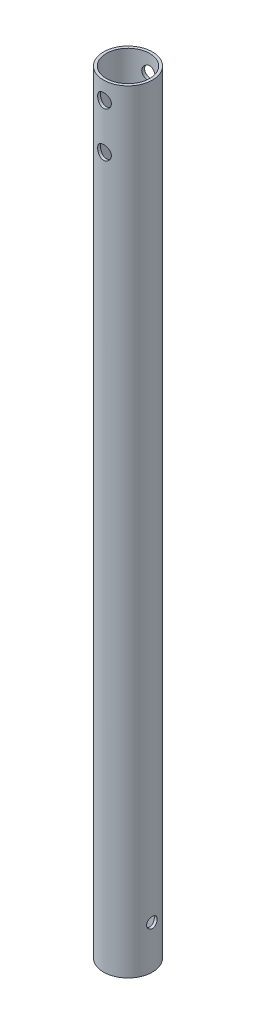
ISO-10303-21;
HEADER;
FILE_DESCRIPTION(('STEP AP214'),'2;1');
FILE_NAME('part.step','',(''),(''),'','','');
FILE_SCHEMA(('AUTOMOTIVE_DESIGN { 1 0 10303 214 1 1 1 1 }'));
ENDSEC;
DATA;
#1=APPLICATION_CONTEXT('core data for automotive mechanical design processes');
#2=APPLICATION_PROTOCOL_DEFINITION('international standard','automotive_design',2000,#1);
#3=PRODUCT_CONTEXT('',#1,'mechanical');
#4=PRODUCT('Part','Part','',(#3));
#5=PRODUCT_RELATED_PRODUCT_CATEGORY('part','',(#4));
#6=PRODUCT_DEFINITION_FORMATION('','',#4);
#7=PRODUCT_DEFINITION_CONTEXT('part definition',#1,'design');
#8=PRODUCT_DEFINITION('design','',#6,#7);
#9=PRODUCT_DEFINITION_SHAPE('','',#8);
#10=(LENGTH_UNIT() NAMED_UNIT(*) SI_UNIT(.MILLI.,.METRE.));
#11=(NAMED_UNIT(*) PLANE_ANGLE_UNIT() SI_UNIT($,.RADIAN.));
#12=(NAMED_UNIT(*) SI_UNIT($,.STERADIAN.) SOLID_ANGLE_UNIT());
#13=UNCERTAINTY_MEASURE_WITH_UNIT(LENGTH_MEASURE(1.E-05),#10,'distance_accuracy_value','');
#14=(GEOMETRIC_REPRESENTATION_CONTEXT(3) GLOBAL_UNCERTAINTY_ASSIGNED_CONTEXT((#13)) GLOBAL_UNIT_ASSIGNED_CONTEXT((#10,
#11,#12)) REPRESENTATION_CONTEXT('',''));
#15=CARTESIAN_POINT('',(0.,0.,0.));
#16=DIRECTION('',(0.,0.,1.));
#17=DIRECTION('',(1.,0.,0.));
#18=AXIS2_PLACEMENT_3D('',#15,#16,#17);
#19=CARTESIAN_POINT('',(0.,197.5,0.));
#20=DIRECTION('',(0.,-1.,0.));
#21=DIRECTION('',(0.,0.,-1.));
#22=AXIS2_PLACEMENT_3D('',#19,#20,#21);
#23=CYLINDRICAL_SURFACE('',#22,6.25);
#24=CARTESIAN_POINT('',(0.,183.25,-6.25));
#25=CARTESIAN_POINT('',(0.0962908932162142,183.249998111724,-6.2499987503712));
#26=CARTESIAN_POINT('',(0.192601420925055,183.242026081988,-6.24775307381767));
#27=CARTESIAN_POINT('',(0.382436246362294,183.210412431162,-6.23901318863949));
#28=CARTESIAN_POINT('',(0.475959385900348,183.186764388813,-6.23251723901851));
#29=CARTESIAN_POINT('',(0.657452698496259,183.12463668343,-6.21599179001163));
#30=CARTESIAN_POINT('',(0.74543024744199,183.086177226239,-6.20596710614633));
#31=CARTESIAN_POINT('',(0.913687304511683,182.995596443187,-6.1834367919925));
#32=CARTESIAN_POINT('',(0.993966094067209,182.943473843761,-6.17093093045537));
#33=CARTESIAN_POINT('',(1.14658134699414,182.825652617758,-6.14442777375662));
#34=CARTESIAN_POINT('',(1.21869496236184,182.759671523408,-6.13040297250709));
#35=CARTESIAN_POINT('',(1.35099162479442,182.616609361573,-6.10261426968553));
#36=CARTESIAN_POINT('',(1.41117296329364,182.539526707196,-6.08885040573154));
#37=CARTESIAN_POINT('',(1.51901628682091,182.374629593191,-6.06285698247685));
#38=CARTESIAN_POINT('',(1.56641588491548,182.286637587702,-6.05066193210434));
#39=CARTESIAN_POINT('',(1.64565786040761,182.103535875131,-6.02959395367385));
#40=CARTESIAN_POINT('',(1.677503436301,182.008427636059,-6.02072034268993));
#41=CARTESIAN_POINT('',(1.72394794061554,181.816275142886,-6.00758496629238));
#42=CARTESIAN_POINT('',(1.73895361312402,181.719336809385,-6.00321465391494));
#43=CARTESIAN_POINT('',(1.75256129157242,181.524227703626,-5.99925691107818));
#44=CARTESIAN_POINT('',(1.751166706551,181.426057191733,-5.99966848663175));
#45=CARTESIAN_POINT('',(1.73233503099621,181.234495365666,-6.00513122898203));
#46=CARTESIAN_POINT('',(1.71539667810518,181.141050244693,-6.01003814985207));
#47=CARTESIAN_POINT('',(1.66675978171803,180.958384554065,-6.02370680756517));
#48=CARTESIAN_POINT('',(1.63505995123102,180.869164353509,-6.03246888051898));
#49=CARTESIAN_POINT('',(1.5574088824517,180.696212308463,-6.05298281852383));
#50=CARTESIAN_POINT('',(1.51128791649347,180.612561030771,-6.06476997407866));
#51=CARTESIAN_POINT('',(1.40622198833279,180.454013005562,-6.08998777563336));
#52=CARTESIAN_POINT('',(1.34727427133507,180.379118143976,-6.10341877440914));
#53=CARTESIAN_POINT('',(1.21570629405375,180.237367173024,-6.13100542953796));
#54=CARTESIAN_POINT('',(1.14266906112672,180.170899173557,-6.14516973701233));
#55=CARTESIAN_POINT('',(0.986309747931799,180.051071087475,-6.17219399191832));
#56=CARTESIAN_POINT('',(0.902987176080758,179.997711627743,-6.1850538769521));
#57=CARTESIAN_POINT('',(0.727781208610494,179.905419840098,-6.20811337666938));
#58=CARTESIAN_POINT('',(0.635855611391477,179.866563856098,-6.21829883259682));
#59=CARTESIAN_POINT('',(0.446425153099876,179.804972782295,-6.23475976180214));
#60=CARTESIAN_POINT('',(0.348921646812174,179.782233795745,-6.24103618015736));
#61=CARTESIAN_POINT('',(0.154410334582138,179.754145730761,-6.24882637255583));
#62=CARTESIAN_POINT('',(0.0574842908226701,179.748269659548,-6.25048442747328));
#63=CARTESIAN_POINT('',(-0.135970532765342,179.752610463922,-6.24926916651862));
#64=CARTESIAN_POINT('',(-0.232499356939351,179.762825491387,-6.24639637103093));
#65=CARTESIAN_POINT('',(-0.42049689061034,179.79862841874,-6.23653593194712));
#66=CARTESIAN_POINT('',(-0.512027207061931,179.823916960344,-6.22962846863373));
#67=CARTESIAN_POINT('',(-0.68953339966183,179.888796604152,-6.21248759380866));
#68=CARTESIAN_POINT('',(-0.775508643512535,179.928389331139,-6.20225380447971));
#69=CARTESIAN_POINT('',(-0.941470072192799,180.021694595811,-6.17926417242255));
#70=CARTESIAN_POINT('',(-1.02129220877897,180.075686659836,-6.16645980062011));
#71=CARTESIAN_POINT('',(-1.17092632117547,180.195911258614,-6.1398059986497));
#72=CARTESIAN_POINT('',(-1.24073610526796,180.262146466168,-6.12595634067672));
#73=CARTESIAN_POINT('',(-1.37062423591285,180.407444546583,-6.09823286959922));
#74=CARTESIAN_POINT('',(-1.43032931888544,180.486844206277,-6.08437188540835));
#75=CARTESIAN_POINT('',(-1.53558316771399,180.654833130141,-6.05866575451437));
#76=CARTESIAN_POINT('',(-1.581132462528,180.743422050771,-6.04682053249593));
#77=CARTESIAN_POINT('',(-1.65644460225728,180.926880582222,-6.02662531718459));
#78=CARTESIAN_POINT('',(-1.68629406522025,181.02171241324,-6.01825620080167));
#79=CARTESIAN_POINT('',(-1.72953558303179,181.215327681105,-6.00597382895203));
#80=CARTESIAN_POINT('',(-1.7429323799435,181.314109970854,-6.00205928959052));
#81=CARTESIAN_POINT('',(-1.752595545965,181.508979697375,-5.99924417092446));
#82=CARTESIAN_POINT('',(-1.74946496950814,181.605035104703,-6.00016707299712));
#83=CARTESIAN_POINT('',(-1.72757686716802,181.795189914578,-6.00650524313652));
#84=CARTESIAN_POINT('',(-1.70881982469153,181.889289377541,-6.01192037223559));
#85=CARTESIAN_POINT('',(-1.65657690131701,182.072014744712,-6.02652243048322));
#86=CARTESIAN_POINT('',(-1.62323114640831,182.160683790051,-6.03567342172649));
#87=CARTESIAN_POINT('',(-1.54286571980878,182.331238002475,-6.05671387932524));
#88=CARTESIAN_POINT('',(-1.49584370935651,182.413122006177,-6.06860381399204));
#89=CARTESIAN_POINT('',(-1.38768511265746,182.570629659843,-6.09426032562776));
#90=CARTESIAN_POINT('',(-1.32614296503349,182.645967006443,-6.10807498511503));
#91=CARTESIAN_POINT('',(-1.19144628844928,182.785440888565,-6.13577017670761));
#92=CARTESIAN_POINT('',(-1.11828887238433,182.84957463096,-6.14965072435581));
#93=CARTESIAN_POINT('',(-0.960293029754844,182.966362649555,-6.17631781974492));
#94=CARTESIAN_POINT('',(-0.875213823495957,183.018699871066,-6.1890695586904));
#95=CARTESIAN_POINT('',(-0.697107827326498,183.108248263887,-6.21164835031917));
#96=CARTESIAN_POINT('',(-0.604085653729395,183.145468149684,-6.22147708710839));
#97=CARTESIAN_POINT('',(-0.426315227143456,183.1994491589,-6.23598872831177));
#98=CARTESIAN_POINT('',(-0.34225689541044,183.218358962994,-6.24120273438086));
#99=CARTESIAN_POINT('',(-0.172137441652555,183.243634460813,-6.24820871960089));
#100=CARTESIAN_POINT('',(-0.086076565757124,183.250001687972,-6.25000111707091));
#101=CARTESIAN_POINT('',(0.,183.25,-6.25));
#102=B_SPLINE_CURVE_WITH_KNOTS('',3,(#24,#25,#26,#27,#28,#29,#30,#31,#32,#33,#34,#35,#36,#37,
#38,#39,#40,#41,#42,#43,#44,#45,#46,#47,#48,#49,#50,#51,#52,#53,#54,#55,#56,#57,#58,#59,#60,#61,
#62,#63,#64,#65,#66,#67,#68,#69,#70,#71,#72,#73,#74,#75,#76,#77,#78,#79,#80,#81,#82,#83,#84,#85,
#86,#87,#88,#89,#90,#91,#92,#93,#94,#95,#96,#97,#98,#99,#100,#101),.UNSPECIFIED.,.T.,.F.,(4,2,2,
2,2,2,2,2,2,2,2,2,2,2,2,2,2,2,2,2,2,2,2,2,2,2,2,2,2,2,2,2,2,2,2,2,2,2,4),(0.,0.288556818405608,
0.57723190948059,0.865514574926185,1.15382412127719,1.44870789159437,1.74363385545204,
2.04421901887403,2.34474234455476,2.63783928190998,2.93087529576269,3.21482574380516,
3.49880095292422,3.78625285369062,4.07376655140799,4.37166606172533,4.66957981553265,
4.96904033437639,5.26842842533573,5.55835251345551,5.8482433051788,6.13256022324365,
6.41690944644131,6.70724074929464,6.99763550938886,7.29712534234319,7.59660398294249,
7.8944125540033,8.19213526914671,8.47907141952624,8.76599869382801,9.05022851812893,
9.33450697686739,9.62793474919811,9.92143557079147,10.2220731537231,10.5225371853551,
10.7805160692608,11.0384634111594),.UNSPECIFIED.);
#103=CARTESIAN_POINT('',(0.,183.25,-6.25));
#104=VERTEX_POINT('',#103);
#105=EDGE_CURVE('E64',#104,#104,#102,.T.);
#106=ORIENTED_EDGE('',*,*,#105,.F.);
#107=EDGE_LOOP('',(#106));
#108=FACE_BOUND('',#107,.T.);
#109=CARTESIAN_POINT('',(0.,194.75,-6.25));
#110=CARTESIAN_POINT('',(0.0962908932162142,194.749998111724,-6.2499987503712));
#111=CARTESIAN_POINT('',(0.192601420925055,194.742026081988,-6.24775307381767));
#112=CARTESIAN_POINT('',(0.382436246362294,194.710412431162,-6.23901318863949));
#113=CARTESIAN_POINT('',(0.475959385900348,194.686764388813,-6.23251723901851));
#114=CARTESIAN_POINT('',(0.657452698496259,194.62463668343,-6.21599179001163));
#115=CARTESIAN_POINT('',(0.74543024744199,194.586177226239,-6.20596710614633));
#116=CARTESIAN_POINT('',(0.913687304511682,194.495596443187,-6.1834367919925));
#117=CARTESIAN_POINT('',(0.993966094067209,194.443473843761,-6.17093093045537));
#118=CARTESIAN_POINT('',(1.14658134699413,194.325652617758,-6.14442777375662));
#119=CARTESIAN_POINT('',(1.21869496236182,194.259671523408,-6.13040297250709));
#120=CARTESIAN_POINT('',(1.3509916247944,194.116609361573,-6.10261426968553));
#121=CARTESIAN_POINT('',(1.41117296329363,194.039526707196,-6.08885040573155));
#122=CARTESIAN_POINT('',(1.51901628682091,193.874629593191,-6.06285698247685));
#123=CARTESIAN_POINT('',(1.56641588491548,193.786637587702,-6.05066193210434));
#124=CARTESIAN_POINT('',(1.64565786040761,193.603535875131,-6.02959395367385));
#125=CARTESIAN_POINT('',(1.677503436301,193.508427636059,-6.02072034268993));
#126=CARTESIAN_POINT('',(1.72394794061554,193.316275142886,-6.00758496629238));
#127=CARTESIAN_POINT('',(1.73895361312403,193.219336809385,-6.00321465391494));
#128=CARTESIAN_POINT('',(1.75256129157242,193.024227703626,-5.99925691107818));
#129=CARTESIAN_POINT('',(1.751166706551,192.926057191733,-5.99966848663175));
#130=CARTESIAN_POINT('',(1.73233503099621,192.734495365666,-6.00513122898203));
#131=CARTESIAN_POINT('',(1.71539667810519,192.641050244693,-6.01003814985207));
#132=CARTESIAN_POINT('',(1.66675978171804,192.458384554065,-6.02370680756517));
#133=CARTESIAN_POINT('',(1.63505995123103,192.369164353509,-6.03246888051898));
#134=CARTESIAN_POINT('',(1.5574088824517,192.196212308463,-6.05298281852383));
#135=CARTESIAN_POINT('',(1.51128791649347,192.112561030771,-6.06476997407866));
#136=CARTESIAN_POINT('',(1.40622198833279,191.954013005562,-6.08998777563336));
#137=CARTESIAN_POINT('',(1.34727427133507,191.879118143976,-6.10341877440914));
#138=CARTESIAN_POINT('',(1.21570629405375,191.737367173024,-6.13100542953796));
#139=CARTESIAN_POINT('',(1.14266906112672,191.670899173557,-6.14516973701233));
#140=CARTESIAN_POINT('',(0.986309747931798,191.551071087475,-6.17219399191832));
#141=CARTESIAN_POINT('',(0.902987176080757,191.497711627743,-6.1850538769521));
#142=CARTESIAN_POINT('',(0.727781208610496,191.405419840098,-6.20811337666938));
#143=CARTESIAN_POINT('',(0.635855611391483,191.366563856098,-6.21829883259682));
#144=CARTESIAN_POINT('',(0.446425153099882,191.304972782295,-6.23475976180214));
#145=CARTESIAN_POINT('',(0.348921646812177,191.282233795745,-6.24103618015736));
#146=CARTESIAN_POINT('',(0.154410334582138,191.254145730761,-6.24882637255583));
#147=CARTESIAN_POINT('',(0.0574842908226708,191.248269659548,-6.25048442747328));
#148=CARTESIAN_POINT('',(-0.13597053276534,191.252610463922,-6.24926916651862));
#149=CARTESIAN_POINT('',(-0.23249935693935,191.262825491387,-6.24639637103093));
#150=CARTESIAN_POINT('',(-0.420496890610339,191.29862841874,-6.23653593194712));
#151=CARTESIAN_POINT('',(-0.51202720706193,191.323916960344,-6.22962846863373));
#152=CARTESIAN_POINT('',(-0.689533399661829,191.388796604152,-6.21248759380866));
#153=CARTESIAN_POINT('',(-0.775508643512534,191.428389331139,-6.20225380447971));
#154=CARTESIAN_POINT('',(-0.941470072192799,191.521694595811,-6.17926417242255));
#155=CARTESIAN_POINT('',(-1.02129220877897,191.575686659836,-6.16645980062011));
#156=CARTESIAN_POINT('',(-1.17092632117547,191.695911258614,-6.1398059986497));
#157=CARTESIAN_POINT('',(-1.24073610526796,191.762146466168,-6.12595634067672));
#158=CARTESIAN_POINT('',(-1.37062423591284,191.907444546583,-6.09823286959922));
#159=CARTESIAN_POINT('',(-1.43032931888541,191.986844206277,-6.08437188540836));
#160=CARTESIAN_POINT('',(-1.53558316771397,192.154833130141,-6.05866575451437));
#161=CARTESIAN_POINT('',(-1.58113246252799,192.243422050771,-6.04682053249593));
#162=CARTESIAN_POINT('',(-1.65644460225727,192.426880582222,-6.02662531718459));
#163=CARTESIAN_POINT('',(-1.68629406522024,192.521712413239,-6.01825620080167));
#164=CARTESIAN_POINT('',(-1.72953558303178,192.715327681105,-6.00597382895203));
#165=CARTESIAN_POINT('',(-1.7429323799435,192.814109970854,-6.00205928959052));
#166=CARTESIAN_POINT('',(-1.752595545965,193.008979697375,-5.99924417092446));
#167=CARTESIAN_POINT('',(-1.74946496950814,193.105035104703,-6.00016707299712));
#168=CARTESIAN_POINT('',(-1.72757686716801,193.295189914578,-6.00650524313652));
#169=CARTESIAN_POINT('',(-1.70881982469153,193.389289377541,-6.01192037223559));
#170=CARTESIAN_POINT('',(-1.65657690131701,193.572014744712,-6.02652243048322));
#171=CARTESIAN_POINT('',(-1.62323114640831,193.660683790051,-6.03567342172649));
#172=CARTESIAN_POINT('',(-1.54286571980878,193.831238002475,-6.05671387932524));
#173=CARTESIAN_POINT('',(-1.49584370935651,193.913122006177,-6.06860381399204));
#174=CARTESIAN_POINT('',(-1.38768511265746,194.070629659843,-6.09426032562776));
#175=CARTESIAN_POINT('',(-1.32614296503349,194.145967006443,-6.10807498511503));
#176=CARTESIAN_POINT('',(-1.19144628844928,194.285440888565,-6.13577017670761));
#177=CARTESIAN_POINT('',(-1.11828887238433,194.34957463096,-6.14965072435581));
#178=CARTESIAN_POINT('',(-0.960293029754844,194.466362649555,-6.17631781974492));
#179=CARTESIAN_POINT('',(-0.875213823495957,194.518699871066,-6.1890695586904));
#180=CARTESIAN_POINT('',(-0.697107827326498,194.608248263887,-6.21164835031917));
#181=CARTESIAN_POINT('',(-0.604085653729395,194.645468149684,-6.22147708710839));
#182=CARTESIAN_POINT('',(-0.426315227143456,194.6994491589,-6.23598872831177));
#183=CARTESIAN_POINT('',(-0.342256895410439,194.718358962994,-6.24120273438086));
#184=CARTESIAN_POINT('',(-0.172137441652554,194.743634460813,-6.24820871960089));
#185=CARTESIAN_POINT('',(-0.0860765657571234,194.750001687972,-6.25000111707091));
#186=CARTESIAN_POINT('',(0.,194.75,-6.25));
#187=B_SPLINE_CURVE_WITH_KNOTS('',3,(#109,#110,#111,#112,#113,#114,#115,#116,#117,#118,#119,
#120,#121,#122,#123,#124,#125,#126,#127,#128,#129,#130,#131,#132,#133,#134,#135,#136,#137,#138,
#139,#140,#141,#142,#143,#144,#145,#146,#147,#148,#149,#150,#151,#152,#153,#154,#155,#156,#157,
#158,#159,#160,#161,#162,#163,#164,#165,#166,#167,#168,#169,#170,#171,#172,#173,#174,#175,#176,
#177,#178,#179,#180,#181,#182,#183,#184,#185,#186),.UNSPECIFIED.,.T.,.F.,(4,2,2,2,2,2,2,2,2,2,2,
2,2,2,2,2,2,2,2,2,2,2,2,2,2,2,2,2,2,2,2,2,2,2,2,2,2,2,4),(0.,0.288556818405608,0.57723190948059,
0.865514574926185,1.15382412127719,1.44870789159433,1.74363385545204,2.04421901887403,
2.34474234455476,2.63783928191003,2.93087529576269,3.2148257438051,3.49880095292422,
3.78625285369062,4.07376655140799,4.37166606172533,4.66957981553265,4.96904033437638,
5.26842842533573,5.55835251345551,5.8482433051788,6.13256022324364,6.41690944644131,
6.70724074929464,6.99763550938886,7.29712534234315,7.59660398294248,7.89441255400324,
8.19213526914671,8.47907141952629,8.76599869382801,9.05022851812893,9.33450697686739,
9.62793474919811,9.92143557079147,10.2220731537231,10.5225371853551,10.7805160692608,
11.0384634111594),.UNSPECIFIED.);
#188=CARTESIAN_POINT('',(0.,194.75,-6.25));
#189=VERTEX_POINT('',#188);
#190=EDGE_CURVE('E90',#189,#189,#187,.T.);
#191=ORIENTED_EDGE('',*,*,#190,.F.);
#192=EDGE_LOOP('',(#191));
#193=FACE_BOUND('',#192,.T.);
#194=CARTESIAN_POINT('',(0.,0.,0.));
#195=DIRECTION('',(0.,1.,0.));
#196=DIRECTION('',(0.,0.,1.));
#197=AXIS2_PLACEMENT_3D('',#194,#195,#196);
#198=CIRCLE('',#197,6.25);
#199=CARTESIAN_POINT('',(0.,0.,6.25));
#200=VERTEX_POINT('',#199);
#201=EDGE_CURVE('E46',#200,#200,#198,.T.);
#202=ORIENTED_EDGE('',*,*,#201,.T.);
#203=EDGE_LOOP('',(#202));
#204=FACE_BOUND('',#203,.T.);
#205=CARTESIAN_POINT('',(0.,197.5,0.));
#206=DIRECTION('',(0.,1.,0.));
#207=DIRECTION('',(0.,0.,1.));
#208=AXIS2_PLACEMENT_3D('',#205,#206,#207);
#209=CIRCLE('',#208,6.25);
#210=CARTESIAN_POINT('',(0.,197.5,6.25));
#211=VERTEX_POINT('',#210);
#212=EDGE_CURVE('E11',#211,#211,#209,.T.);
#213=ORIENTED_EDGE('',*,*,#212,.F.);
#214=EDGE_LOOP('',(#213));
#215=FACE_BOUND('',#214,.T.);
#216=CARTESIAN_POINT('',(-1.75,193.,6.));
#217=CARTESIAN_POINT('',(-1.74999807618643,192.903792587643,6.00000145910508));
#218=CARTESIAN_POINT('',(-1.74203938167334,192.807565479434,6.00233927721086));
#219=CARTESIAN_POINT('',(-1.71048349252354,192.617903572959,6.01140642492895));
#220=CARTESIAN_POINT('',(-1.68687948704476,192.524470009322,6.0181376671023));
#221=CARTESIAN_POINT('',(-1.62488043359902,192.34316686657,6.03517085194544));
#222=CARTESIAN_POINT('',(-1.58650763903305,192.255289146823,6.0454674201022));
#223=CARTESIAN_POINT('',(-1.4961314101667,192.087201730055,6.06846408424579));
#224=CARTESIAN_POINT('',(-1.44412652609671,192.006992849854,6.08116443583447));
#225=CARTESIAN_POINT('',(-1.32642844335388,191.854308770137,6.10793015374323));
#226=CARTESIAN_POINT('',(-1.26042624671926,191.782076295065,6.12202166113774));
#227=CARTESIAN_POINT('',(-1.1172707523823,191.649547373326,6.14975722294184));
#228=CARTESIAN_POINT('',(-1.04011619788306,191.58925227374,6.16340122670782));
#229=CARTESIAN_POINT('',(-0.875146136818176,191.481281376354,6.18899821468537));
#230=CARTESIAN_POINT('',(-0.787165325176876,191.433849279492,6.20091677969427));
#231=CARTESIAN_POINT('',(-0.604087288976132,191.35454424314,6.22141859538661));
#232=CARTESIAN_POINT('',(-0.508991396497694,191.322668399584,6.23000246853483));
#233=CARTESIAN_POINT('',(-0.316918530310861,191.276173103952,6.24268284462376));
#234=CARTESIAN_POINT('',(-0.2200488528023,191.261140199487,6.24688667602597));
#235=CARTESIAN_POINT('',(-0.0250772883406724,191.247454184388,6.25070961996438));
#236=CARTESIAN_POINT('',(0.0730243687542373,191.248798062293,6.25032957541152));
#237=CARTESIAN_POINT('',(0.264788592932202,191.267541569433,6.24510515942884));
#238=CARTESIAN_POINT('',(0.358498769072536,191.284494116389,6.24038510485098));
#239=CARTESIAN_POINT('',(0.541686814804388,191.33324836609,6.22715939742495));
#240=CARTESIAN_POINT('',(0.631164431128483,191.365050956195,6.21865351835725));
#241=CARTESIAN_POINT('',(0.804458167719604,191.44292949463,6.19863236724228));
#242=CARTESIAN_POINT('',(0.888203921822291,191.489153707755,6.18708603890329));
#243=CARTESIAN_POINT('',(1.04689885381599,191.594448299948,6.16222071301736));
#244=CARTESIAN_POINT('',(1.12184616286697,191.653521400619,6.14890134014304));
#245=CARTESIAN_POINT('',(1.26348587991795,191.785189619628,6.12139601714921));
#246=CARTESIAN_POINT('',(1.3298143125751,191.858173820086,6.10719599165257));
#247=CARTESIAN_POINT('',(1.44938464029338,192.014373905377,6.07993054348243));
#248=CARTESIAN_POINT('',(1.50262555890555,192.097590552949,6.06686520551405));
#249=CARTESIAN_POINT('',(1.59482525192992,192.272747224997,6.0432875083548));
#250=CARTESIAN_POINT('',(1.63367540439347,192.364747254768,6.03279476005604));
#251=CARTESIAN_POINT('',(1.69523316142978,192.55434212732,6.01578888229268));
#252=CARTESIAN_POINT('',(1.71794524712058,192.651935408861,6.00927464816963));
#253=CARTESIAN_POINT('',(1.74593444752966,192.846518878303,6.00120151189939));
#254=CARTESIAN_POINT('',(1.75175852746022,192.943424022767,5.99948721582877));
#255=CARTESIAN_POINT('',(1.74732135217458,193.136825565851,6.00078111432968));
#256=CARTESIAN_POINT('',(1.73706201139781,193.233322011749,6.00378874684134));
#257=CARTESIAN_POINT('',(1.70123342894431,193.420993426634,6.01403655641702));
#258=CARTESIAN_POINT('',(1.67600192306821,193.512238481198,6.02118328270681));
#259=CARTESIAN_POINT('',(1.61132952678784,193.689198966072,6.03881057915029));
#260=CARTESIAN_POINT('',(1.57188664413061,193.774913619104,6.04929161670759));
#261=CARTESIAN_POINT('',(1.47882924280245,193.940643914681,6.07271867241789));
#262=CARTESIAN_POINT('',(1.42489844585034,194.020474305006,6.08571763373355));
#263=CARTESIAN_POINT('',(1.30478169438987,194.170152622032,6.11259562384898));
#264=CARTESIAN_POINT('',(1.23859319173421,194.239998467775,6.12647483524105));
#265=CARTESIAN_POINT('',(1.09329365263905,194.370042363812,6.15409146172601));
#266=CARTESIAN_POINT('',(1.01383461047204,194.429856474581,6.1678098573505));
#267=CARTESIAN_POINT('',(0.845690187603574,194.535302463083,6.19310303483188));
#268=CARTESIAN_POINT('',(0.757005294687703,194.580935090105,6.20467792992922));
#269=CARTESIAN_POINT('',(0.573546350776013,194.656291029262,6.22430565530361));
#270=CARTESIAN_POINT('',(0.478824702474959,194.686134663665,6.2323850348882));
#271=CARTESIAN_POINT('',(0.28544801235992,194.729401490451,6.24422857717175));
#272=CARTESIAN_POINT('',(0.186793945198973,194.742828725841,6.24799380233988));
#273=CARTESIAN_POINT('',(-0.00807593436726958,194.7526069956,6.25072895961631));
#274=CARTESIAN_POINT('',(-0.104261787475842,194.749518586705,6.24985631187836));
#275=CARTESIAN_POINT('',(-0.294689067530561,194.727669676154,6.24377559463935));
#276=CARTESIAN_POINT('',(-0.388930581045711,194.708909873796,6.23856771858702));
#277=CARTESIAN_POINT('',(-0.572046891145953,194.65658011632,6.22443844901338));
#278=CARTESIAN_POINT('',(-0.660959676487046,194.623134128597,6.21554817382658));
#279=CARTESIAN_POINT('',(-0.831961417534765,194.542491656,6.19497907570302));
#280=CARTESIAN_POINT('',(-0.914049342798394,194.495293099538,6.18329983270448));
#281=CARTESIAN_POINT('',(-1.07163842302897,194.386902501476,6.15797439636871));
#282=CARTESIAN_POINT('',(-1.14688156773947,194.325346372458,6.14428121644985));
#283=CARTESIAN_POINT('',(-1.28615923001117,194.190664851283,6.11664503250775));
#284=CARTESIAN_POINT('',(-1.35019068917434,194.117536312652,6.10270196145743));
#285=CARTESIAN_POINT('',(-1.46681750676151,193.959594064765,6.07574077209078));
#286=CARTESIAN_POINT('',(-1.51908793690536,193.874534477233,6.06275438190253));
#287=CARTESIAN_POINT('',(-1.60851630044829,193.696481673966,6.03964586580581));
#288=CARTESIAN_POINT('',(-1.64568313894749,193.603493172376,6.02952205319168));
#289=CARTESIAN_POINT('',(-1.69956084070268,193.425847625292,6.01453714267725));
#290=CARTESIAN_POINT('',(-1.71842826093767,193.341884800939,6.00913257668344));
#291=CARTESIAN_POINT('',(-1.74364780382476,193.171953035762,6.00186360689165));
#292=CARTESIAN_POINT('',(-1.75000171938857,193.085984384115,5.99999869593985));
#293=CARTESIAN_POINT('',(-1.75,193.,6.));
#294=B_SPLINE_CURVE_WITH_KNOTS('',3,(#216,#217,#218,#219,#220,#221,#222,#223,#224,#225,#226,
#227,#228,#229,#230,#231,#232,#233,#234,#235,#236,#237,#238,#239,#240,#241,#242,#243,#244,#245,
#246,#247,#248,#249,#250,#251,#252,#253,#254,#255,#256,#257,#258,#259,#260,#261,#262,#263,#264,
#265,#266,#267,#268,#269,#270,#271,#272,#273,#274,#275,#276,#277,#278,#279,#280,#281,#282,#283,
#284,#285,#286,#287,#288,#289,#290,#291,#292,#293),.UNSPECIFIED.,.T.,.F.,(4,2,2,2,2,2,2,2,2,2,2,
2,2,2,2,2,2,2,2,2,2,2,2,2,2,2,2,2,2,2,2,2,2,2,2,2,2,2,4),(0.,0.288305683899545,
0.576736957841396,0.864735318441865,1.15276432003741,1.4479756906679,1.74322035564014,
2.04371984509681,2.34416321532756,2.63705779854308,2.92989852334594,3.21460383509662,
3.49932616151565,3.78707786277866,4.07489057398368,4.37241702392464,4.66996566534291,
4.96971653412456,5.26938413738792,5.55923142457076,5.84904421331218,6.13255555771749,
6.41610666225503,6.70643709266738,6.9968279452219,7.29658706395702,7.59633034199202,
7.89375522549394,8.19110684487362,8.47843150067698,8.76574333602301,9.05067521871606,
9.33565004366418,9.62883779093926,9.92210539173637,10.2226847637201,10.5230866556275,
10.7807938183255,11.0384640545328),.UNSPECIFIED.);
#295=CARTESIAN_POINT('',(-1.75,193.,6.));
#296=VERTEX_POINT('',#295);
#297=EDGE_CURVE('E85',#296,#296,#294,.T.);
#298=ORIENTED_EDGE('',*,*,#297,.F.);
#299=EDGE_LOOP('',(#298));
#300=FACE_BOUND('',#299,.T.);
#301=CARTESIAN_POINT('',(-1.75,181.5,6.));
#302=CARTESIAN_POINT('',(-1.74999807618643,181.403792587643,6.00000145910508));
#303=CARTESIAN_POINT('',(-1.74203938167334,181.307565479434,6.00233927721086));
#304=CARTESIAN_POINT('',(-1.71048349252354,181.117903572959,6.01140642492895));
#305=CARTESIAN_POINT('',(-1.68687948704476,181.024470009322,6.0181376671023));
#306=CARTESIAN_POINT('',(-1.62488043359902,180.84316686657,6.03517085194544));
#307=CARTESIAN_POINT('',(-1.58650763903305,180.755289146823,6.0454674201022));
#308=CARTESIAN_POINT('',(-1.4961314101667,180.587201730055,6.06846408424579));
#309=CARTESIAN_POINT('',(-1.44412652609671,180.506992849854,6.08116443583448));
#310=CARTESIAN_POINT('',(-1.32642844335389,180.354308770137,6.10793015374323));
#311=CARTESIAN_POINT('',(-1.26042624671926,180.282076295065,6.12202166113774));
#312=CARTESIAN_POINT('',(-1.1172707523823,180.149547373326,6.14975722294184));
#313=CARTESIAN_POINT('',(-1.04011619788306,180.08925227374,6.16340122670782));
#314=CARTESIAN_POINT('',(-0.875146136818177,179.981281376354,6.18899821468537));
#315=CARTESIAN_POINT('',(-0.787165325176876,179.933849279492,6.20091677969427));
#316=CARTESIAN_POINT('',(-0.604087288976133,179.85454424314,6.22141859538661));
#317=CARTESIAN_POINT('',(-0.508991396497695,179.822668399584,6.23000246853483));
#318=CARTESIAN_POINT('',(-0.316918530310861,179.776173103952,6.24268284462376));
#319=CARTESIAN_POINT('',(-0.2200488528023,179.761140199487,6.24688667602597));
#320=CARTESIAN_POINT('',(-0.0250772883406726,179.747454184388,6.25070961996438));
#321=CARTESIAN_POINT('',(0.0730243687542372,179.748798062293,6.25032957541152));
#322=CARTESIAN_POINT('',(0.264788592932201,179.767541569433,6.24510515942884));
#323=CARTESIAN_POINT('',(0.358498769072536,179.784494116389,6.24038510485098));
#324=CARTESIAN_POINT('',(0.541686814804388,179.83324836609,6.22715939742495));
#325=CARTESIAN_POINT('',(0.631164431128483,179.865050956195,6.21865351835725));
#326=CARTESIAN_POINT('',(0.804458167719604,179.94292949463,6.19863236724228));
#327=CARTESIAN_POINT('',(0.888203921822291,179.989153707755,6.18708603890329));
#328=CARTESIAN_POINT('',(1.04689885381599,180.094448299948,6.16222071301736));
#329=CARTESIAN_POINT('',(1.12184616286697,180.153521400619,6.14890134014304));
#330=CARTESIAN_POINT('',(1.26348587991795,180.285189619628,6.12139601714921));
#331=CARTESIAN_POINT('',(1.3298143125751,180.358173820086,6.10719599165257));
#332=CARTESIAN_POINT('',(1.44938464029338,180.514373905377,6.07993054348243));
#333=CARTESIAN_POINT('',(1.50262555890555,180.597590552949,6.06686520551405));
#334=CARTESIAN_POINT('',(1.59482525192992,180.772747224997,6.0432875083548));
#335=CARTESIAN_POINT('',(1.63367540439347,180.864747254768,6.03279476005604));
#336=CARTESIAN_POINT('',(1.69523316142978,181.05434212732,6.01578888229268));
#337=CARTESIAN_POINT('',(1.71794524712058,181.151935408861,6.00927464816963));
#338=CARTESIAN_POINT('',(1.74593444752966,181.346518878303,6.00120151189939));
#339=CARTESIAN_POINT('',(1.75175852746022,181.443424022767,5.99948721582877));
#340=CARTESIAN_POINT('',(1.74732135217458,181.636825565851,6.00078111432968));
#341=CARTESIAN_POINT('',(1.73706201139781,181.733322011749,6.00378874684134));
#342=CARTESIAN_POINT('',(1.70123342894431,181.920993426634,6.01403655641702));
#343=CARTESIAN_POINT('',(1.67600192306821,182.012238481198,6.02118328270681));
#344=CARTESIAN_POINT('',(1.61132952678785,182.189198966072,6.03881057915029));
#345=CARTESIAN_POINT('',(1.57188664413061,182.274913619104,6.04929161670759));
#346=CARTESIAN_POINT('',(1.47882924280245,182.440643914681,6.07271867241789));
#347=CARTESIAN_POINT('',(1.42489844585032,182.520474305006,6.08571763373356));
#348=CARTESIAN_POINT('',(1.30478169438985,182.670152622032,6.11259562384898));
#349=CARTESIAN_POINT('',(1.23859319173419,182.739998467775,6.12647483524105));
#350=CARTESIAN_POINT('',(1.09329365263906,182.870042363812,6.15409146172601));
#351=CARTESIAN_POINT('',(1.01383461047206,182.929856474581,6.1678098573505));
#352=CARTESIAN_POINT('',(0.845690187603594,183.035302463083,6.19310303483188));
#353=CARTESIAN_POINT('',(0.757005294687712,183.080935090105,6.20467792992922));
#354=CARTESIAN_POINT('',(0.573546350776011,183.156291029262,6.22430565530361));
#355=CARTESIAN_POINT('',(0.478824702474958,183.186134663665,6.2323850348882));
#356=CARTESIAN_POINT('',(0.28544801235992,183.229401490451,6.24422857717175));
#357=CARTESIAN_POINT('',(0.186793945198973,183.242828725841,6.24799380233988));
#358=CARTESIAN_POINT('',(-0.00807593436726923,183.2526069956,6.25072895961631));
#359=CARTESIAN_POINT('',(-0.104261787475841,183.249518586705,6.24985631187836));
#360=CARTESIAN_POINT('',(-0.29468906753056,183.227669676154,6.24377559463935));
#361=CARTESIAN_POINT('',(-0.388930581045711,183.208909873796,6.23856771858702));
#362=CARTESIAN_POINT('',(-0.572046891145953,183.15658011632,6.22443844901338));
#363=CARTESIAN_POINT('',(-0.660959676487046,183.123134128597,6.21554817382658));
#364=CARTESIAN_POINT('',(-0.831961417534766,183.042491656,6.19497907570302));
#365=CARTESIAN_POINT('',(-0.914049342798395,182.995293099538,6.18329983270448));
#366=CARTESIAN_POINT('',(-1.07163842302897,182.886902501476,6.15797439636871));
#367=CARTESIAN_POINT('',(-1.14688156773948,182.825346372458,6.14428121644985));
#368=CARTESIAN_POINT('',(-1.28615923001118,182.690664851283,6.11664503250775));
#369=CARTESIAN_POINT('',(-1.35019068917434,182.617536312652,6.10270196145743));
#370=CARTESIAN_POINT('',(-1.46681750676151,182.459594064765,6.07574077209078));
#371=CARTESIAN_POINT('',(-1.51908793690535,182.374534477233,6.06275438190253));
#372=CARTESIAN_POINT('',(-1.60851630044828,182.196481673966,6.03964586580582));
#373=CARTESIAN_POINT('',(-1.64568313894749,182.103493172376,6.02952205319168));
#374=CARTESIAN_POINT('',(-1.69956084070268,181.925847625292,6.01453714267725));
#375=CARTESIAN_POINT('',(-1.71842826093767,181.841884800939,6.00913257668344));
#376=CARTESIAN_POINT('',(-1.74364780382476,181.671953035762,6.00186360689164));
#377=CARTESIAN_POINT('',(-1.75000171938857,181.585984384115,5.99999869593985));
#378=CARTESIAN_POINT('',(-1.75,181.5,6.));
#379=B_SPLINE_CURVE_WITH_KNOTS('',3,(#301,#302,#303,#304,#305,#306,#307,#308,#309,#310,#311,
#312,#313,#314,#315,#316,#317,#318,#319,#320,#321,#322,#323,#324,#325,#326,#327,#328,#329,#330,
#331,#332,#333,#334,#335,#336,#337,#338,#339,#340,#341,#342,#343,#344,#345,#346,#347,#348,#349,
#350,#351,#352,#353,#354,#355,#356,#357,#358,#359,#360,#361,#362,#363,#364,#365,#366,#367,#368,
#369,#370,#371,#372,#373,#374,#375,#376,#377,#378),.UNSPECIFIED.,.T.,.F.,(4,2,2,2,2,2,2,2,2,2,2,
2,2,2,2,2,2,2,2,2,2,2,2,2,2,2,2,2,2,2,2,2,2,2,2,2,2,2,4),(0.,0.288305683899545,
0.576736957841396,0.864735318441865,1.15276432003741,1.4479756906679,1.74322035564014,
2.04371984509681,2.34416321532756,2.63705779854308,2.92989852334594,3.21460383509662,
3.49932616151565,3.78707786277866,4.07489057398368,4.37241702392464,4.66996566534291,
4.96971653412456,5.26938413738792,5.55923142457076,5.84904421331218,6.13255555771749,
6.41610666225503,6.70643709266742,6.9968279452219,7.296587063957,7.59633034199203,
7.89375522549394,8.19110684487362,8.47843150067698,8.76574333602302,9.05067521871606,
9.33565004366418,9.62883779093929,9.92210539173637,10.2226847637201,10.5230866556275,
10.7807938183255,11.0384640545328),.UNSPECIFIED.);
#380=CARTESIAN_POINT('',(-1.75,181.5,6.));
#381=VERTEX_POINT('',#380);
#382=EDGE_CURVE('E126',#381,#381,#379,.T.);
#383=ORIENTED_EDGE('',*,*,#382,.F.);
#384=EDGE_LOOP('',(#383));
#385=FACE_BOUND('',#384,.T.);
#386=CARTESIAN_POINT('',(6.10245852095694,11.,1.35));
#387=CARTESIAN_POINT('',(6.10246003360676,10.9251251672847,1.34999739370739));
#388=CARTESIAN_POINT('',(6.10385155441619,10.8502187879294,1.34374966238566));
#389=CARTESIAN_POINT('',(6.10925736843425,10.7025345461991,1.3189501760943));
#390=CARTESIAN_POINT('',(6.1132735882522,10.6297582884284,1.30038938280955));
#391=CARTESIAN_POINT('',(6.12345320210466,10.488492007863,1.25157407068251));
#392=CARTESIAN_POINT('',(6.12961427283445,10.4199974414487,1.22133220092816));
#393=CARTESIAN_POINT('',(6.14338660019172,10.2890531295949,1.15004916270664));
#394=CARTESIAN_POINT('',(6.15099781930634,10.2266032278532,1.10900827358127));
#395=CARTESIAN_POINT('',(6.16695296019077,10.1084906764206,1.01657138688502));
#396=CARTESIAN_POINT('',(6.17530605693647,10.0529421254,0.965031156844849));
#397=CARTESIAN_POINT('',(6.1917233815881,9.95120789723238,0.853370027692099));
#398=CARTESIAN_POINT('',(6.19978758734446,9.90502293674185,0.793248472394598));
#399=CARTESIAN_POINT('',(6.21481828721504,9.82287686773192,0.665367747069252));
#400=CARTESIAN_POINT('',(6.22177269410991,9.78702530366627,0.597536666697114));
#401=CARTESIAN_POINT('',(6.23369667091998,9.72727215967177,0.456637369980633));
#402=CARTESIAN_POINT('',(6.2386664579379,9.7033692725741,0.383569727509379));
#403=CARTESIAN_POINT('',(6.24599640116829,9.66855030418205,0.23545746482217));
#404=CARTESIAN_POINT('',(6.24839530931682,9.6574411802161,0.160460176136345));
#405=CARTESIAN_POINT('',(6.25044740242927,9.64792171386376,0.00963058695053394));
#406=CARTESIAN_POINT('',(6.2501008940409,9.6495099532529,-0.0662016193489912));
#407=CARTESIAN_POINT('',(6.24673087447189,9.66519595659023,-0.215218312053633));
#408=CARTESIAN_POINT('',(6.24375188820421,9.67908566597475,-0.288425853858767));
#409=CARTESIAN_POINT('',(6.23550228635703,9.71864902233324,-0.431445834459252));
#410=CARTESIAN_POINT('',(6.23023156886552,9.74432319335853,-0.501258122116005));
#411=CARTESIAN_POINT('',(6.21791885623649,9.80691201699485,-0.636085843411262));
#412=CARTESIAN_POINT('',(6.21086443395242,9.84390593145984,-0.701063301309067));
#413=CARTESIAN_POINT('',(6.19575845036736,9.92802508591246,-0.823964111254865));
#414=CARTESIAN_POINT('',(6.18770675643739,9.97515167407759,-0.881886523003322));
#415=CARTESIAN_POINT('',(6.17129932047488,10.0793324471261,-0.99027004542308));
#416=CARTESIAN_POINT('',(6.16294072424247,10.1365687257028,-1.04055584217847));
#417=CARTESIAN_POINT('',(6.14701494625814,10.2587479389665,-1.13084725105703));
#418=CARTESIAN_POINT('',(6.13944778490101,10.3236910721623,-1.17085259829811));
#419=CARTESIAN_POINT('',(6.12595439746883,10.459719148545,-1.23952275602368));
#420=CARTESIAN_POINT('',(6.12003287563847,10.530820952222,-1.26815515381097));
#421=CARTESIAN_POINT('',(6.11056693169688,10.6769848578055,-1.3130128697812));
#422=CARTESIAN_POINT('',(6.10702214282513,10.7520463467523,-1.32924010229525));
#423=CARTESIAN_POINT('',(6.1027856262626,10.9023989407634,-1.34855642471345));
#424=CARTESIAN_POINT('',(6.10203854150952,10.9776557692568,-1.3519004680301));
#425=CARTESIAN_POINT('',(6.10333280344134,11.1276516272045,-1.3460451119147));
#426=CARTESIAN_POINT('',(6.10537396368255,11.2023906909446,-1.33684655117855));
#427=CARTESIAN_POINT('',(6.11196251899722,11.3483463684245,-1.3063880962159));
#428=CARTESIAN_POINT('',(6.1164808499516,11.4195935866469,-1.28526799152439));
#429=CARTESIAN_POINT('',(6.1274885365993,11.557538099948,-1.23171704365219));
#430=CARTESIAN_POINT('',(6.13397807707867,11.6242349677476,-1.19928514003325));
#431=CARTESIAN_POINT('',(6.14831901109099,11.7522906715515,-1.1234671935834));
#432=CARTESIAN_POINT('',(6.15618942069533,11.8135541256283,-1.07992372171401));
#433=CARTESIAN_POINT('',(6.1723548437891,11.9279979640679,-0.983325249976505));
#434=CARTESIAN_POINT('',(6.18064990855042,11.9811773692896,-0.930269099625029));
#435=CARTESIAN_POINT('',(6.19691205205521,12.0789296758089,-0.814999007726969));
#436=CARTESIAN_POINT('',(6.20487045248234,12.1233289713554,-0.752636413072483));
#437=CARTESIAN_POINT('',(6.21940424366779,12.2010207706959,-0.621189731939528));
#438=CARTESIAN_POINT('',(6.22597969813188,12.2343137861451,-0.552105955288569));
#439=CARTESIAN_POINT('',(6.23697005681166,12.288604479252,-0.409602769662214));
#440=CARTESIAN_POINT('',(6.24139842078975,12.3096789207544,-0.336213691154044));
#441=CARTESIAN_POINT('',(6.24765376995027,12.3391745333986,-0.186830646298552));
#442=CARTESIAN_POINT('',(6.24948112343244,12.3475974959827,-0.110837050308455));
#443=CARTESIAN_POINT('',(6.25031795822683,12.3514721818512,0.0399482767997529));
#444=CARTESIAN_POINT('',(6.24938380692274,12.3471833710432,0.114733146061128));
#445=CARTESIAN_POINT('',(6.24492302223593,12.3263354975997,0.262489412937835));
#446=CARTESIAN_POINT('',(6.24139643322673,12.3097766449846,0.335460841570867));
#447=CARTESIAN_POINT('',(6.23215080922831,12.2649817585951,0.477324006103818));
#448=CARTESIAN_POINT('',(6.2264385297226,12.2367816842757,0.546227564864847));
#449=CARTESIAN_POINT('',(6.21343225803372,12.1695402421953,0.678360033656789));
#450=CARTESIAN_POINT('',(6.20613811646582,12.1304978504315,0.74158840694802));
#451=CARTESIAN_POINT('',(6.19059556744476,12.0418295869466,0.861843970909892));
#452=CARTESIAN_POINT('',(6.18233196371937,11.9920207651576,0.918734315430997));
#453=CARTESIAN_POINT('',(6.16586494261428,11.8836036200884,1.02343796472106));
#454=CARTESIAN_POINT('',(6.15766154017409,11.8249931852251,1.07124908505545));
#455=CARTESIAN_POINT('',(6.14212538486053,11.6997228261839,1.15703322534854));
#456=CARTESIAN_POINT('',(6.13480530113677,11.6329683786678,1.19487063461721));
#457=CARTESIAN_POINT('',(6.12202315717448,11.493905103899,1.25873001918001));
#458=CARTESIAN_POINT('',(6.11655950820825,11.4216010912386,1.28476210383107));
#459=CARTESIAN_POINT('',(6.10913124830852,11.2910076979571,1.31956342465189));
#460=CARTESIAN_POINT('',(6.10664541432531,11.2334325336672,1.33095547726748));
#461=CARTESIAN_POINT('',(6.10330849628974,11.1172446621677,1.3461746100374));
#462=CARTESIAN_POINT('',(6.10245733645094,11.0586320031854,1.35000204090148));
#463=CARTESIAN_POINT('',(6.10245852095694,11.,1.35));
#464=B_SPLINE_CURVE_WITH_KNOTS('',3,(#386,#387,#388,#389,#390,#391,#392,#393,#394,#395,#396,
#397,#398,#399,#400,#401,#402,#403,#404,#405,#406,#407,#408,#409,#410,#411,#412,#413,#414,#415,
#416,#417,#418,#419,#420,#421,#422,#423,#424,#425,#426,#427,#428,#429,#430,#431,#432,#433,#434,
#435,#436,#437,#438,#439,#440,#441,#442,#443,#444,#445,#446,#447,#448,#449,#450,#451,#452,#453,
#454,#455,#456,#457,#458,#459,#460,#461,#462,#463),.UNSPECIFIED.,.T.,.F.,(4,2,2,2,2,2,2,2,2,2,2,
2,2,2,2,2,2,2,2,2,2,2,2,2,2,2,2,2,2,2,2,2,2,2,2,2,2,2,4),(0.,0.224409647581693,
0.448984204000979,0.673316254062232,0.897642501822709,1.12528795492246,1.35295082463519,
1.58294515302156,1.81291431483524,2.03936607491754,2.26579254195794,2.48846107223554,
2.71113950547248,2.93541428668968,3.15971892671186,3.38857649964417,3.61743996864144,
3.84695109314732,4.07642679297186,4.30133720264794,4.52623257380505,4.74854407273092,
4.97087641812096,5.19655297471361,5.42225684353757,5.65205465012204,5.88184186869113,
6.11016934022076,6.33846447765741,6.56213207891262,6.78579585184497,7.00877384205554,
7.2317728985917,7.458910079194,7.68610183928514,7.91623961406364,8.14617993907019,
8.32191585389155,8.49764362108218),.UNSPECIFIED.);
#465=CARTESIAN_POINT('',(6.10245852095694,11.,1.35));
#466=VERTEX_POINT('',#465);
#467=EDGE_CURVE('E118',#466,#466,#464,.T.);
#468=ORIENTED_EDGE('',*,*,#467,.F.);
#469=EDGE_LOOP('',(#468));
#470=FACE_BOUND('',#469,.T.);
#471=ADVANCED_FACE('F34',(#108,#193,#204,#215,#300,#385,#470),#23,.T.);
#472=CARTESIAN_POINT('',(0.,197.5,0.));
#473=DIRECTION('',(0.,-1.,0.));
#474=DIRECTION('',(0.,0.,-1.));
#475=AXIS2_PLACEMENT_3D('',#472,#473,#474);
#476=CYLINDRICAL_SURFACE('',#475,5.55);
#477=CARTESIAN_POINT('',(0.,183.25,-5.55));
#478=CARTESIAN_POINT('',(0.0957714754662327,183.24999950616,-5.5499996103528));
#479=CARTESIAN_POINT('',(0.19154829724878,183.242112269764,-5.54749770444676));
#480=CARTESIAN_POINT('',(0.380298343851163,183.210856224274,-5.53776239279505));
#481=CARTESIAN_POINT('',(0.473270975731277,183.187484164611,-5.53052799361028));
#482=CARTESIAN_POINT('',(0.65366365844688,183.12612690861,-5.51211744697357));
#483=CARTESIAN_POINT('',(0.741092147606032,183.088164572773,-5.50094746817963));
#484=CARTESIAN_POINT('',(0.908342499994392,182.998802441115,-5.47581732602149));
#485=CARTESIAN_POINT('',(0.988163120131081,182.947400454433,-5.46185670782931));
#486=CARTESIAN_POINT('',(1.14043727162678,182.830920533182,-5.43213546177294));
#487=CARTESIAN_POINT('',(1.21261860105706,182.76549693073,-5.41633509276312));
#488=CARTESIAN_POINT('',(1.34518801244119,182.623566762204,-5.38494378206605));
#489=CARTESIAN_POINT('',(1.40557384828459,182.547058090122,-5.36935288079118));
#490=CARTESIAN_POINT('',(1.5143242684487,182.382760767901,-5.33971792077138));
#491=CARTESIAN_POINT('',(1.56234699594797,182.294736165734,-5.32572283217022));
#492=CARTESIAN_POINT('',(1.64279394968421,182.111347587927,-5.301462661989));
#493=CARTESIAN_POINT('',(1.67522236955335,182.015985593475,-5.29119657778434));
#494=CARTESIAN_POINT('',(1.7225608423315,181.823704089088,-5.27597283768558));
#495=CARTESIAN_POINT('',(1.73797652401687,181.726921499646,-5.27086237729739));
#496=CARTESIAN_POINT('',(1.75243172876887,181.532019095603,-5.26607504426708));
#497=CARTESIAN_POINT('',(1.75147569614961,181.433899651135,-5.2663966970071));
#498=CARTESIAN_POINT('',(1.73360969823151,181.2433080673,-5.27230249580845));
#499=CARTESIAN_POINT('',(1.71734469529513,181.150767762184,-5.277673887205));
#500=CARTESIAN_POINT('',(1.67036902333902,180.969803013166,-5.29272798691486));
#501=CARTESIAN_POINT('',(1.63965679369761,180.881379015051,-5.30241116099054));
#502=CARTESIAN_POINT('',(1.56420744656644,180.709629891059,-5.32515930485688));
#503=CARTESIAN_POINT('',(1.51926932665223,180.62639969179,-5.33827224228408));
#504=CARTESIAN_POINT('',(1.41678340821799,180.468450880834,-5.36638068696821));
#505=CARTESIAN_POINT('',(1.35923228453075,180.393734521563,-5.38137669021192));
#506=CARTESIAN_POINT('',(1.22999802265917,180.25129091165,-5.41241294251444));
#507=CARTESIAN_POINT('',(1.15778311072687,180.184048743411,-5.42846936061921));
#508=CARTESIAN_POINT('',(1.00290231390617,180.062510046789,-5.45920433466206));
#509=CARTESIAN_POINT('',(0.920235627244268,180.008214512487,-5.47388278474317));
#510=CARTESIAN_POINT('',(0.745850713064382,179.913773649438,-5.50036692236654));
#511=CARTESIAN_POINT('',(0.654064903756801,179.87374589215,-5.51214850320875));
#512=CARTESIAN_POINT('',(0.464604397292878,179.809843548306,-5.53133731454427));
#513=CARTESIAN_POINT('',(0.366931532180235,179.78596396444,-5.53874589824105));
#514=CARTESIAN_POINT('',(0.172585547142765,179.755866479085,-5.54813537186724));
#515=CARTESIAN_POINT('',(0.0760236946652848,179.74899205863,-5.55031791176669));
#516=CARTESIAN_POINT('',(-0.116885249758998,179.751246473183,-5.54960687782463));
#517=CARTESIAN_POINT('',(-0.213232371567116,179.760372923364,-5.54671406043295));
#518=CARTESIAN_POINT('',(-0.400432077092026,179.79384390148,-5.53630995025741));
#519=CARTESIAN_POINT('',(-0.491362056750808,179.817796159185,-5.52891778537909));
#520=CARTESIAN_POINT('',(-0.667885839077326,179.879758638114,-5.51038220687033));
#521=CARTESIAN_POINT('',(-0.753478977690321,179.917770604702,-5.49923832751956));
#522=CARTESIAN_POINT('',(-0.919246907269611,180.007819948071,-5.47400151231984));
#523=CARTESIAN_POINT('',(-0.999236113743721,180.060179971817,-5.45984265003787));
#524=CARTESIAN_POINT('',(-1.14951212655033,180.177053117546,-5.4301932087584));
#525=CARTESIAN_POINT('',(-1.2197962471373,180.241569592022,-5.41470226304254));
#526=CARTESIAN_POINT('',(-1.35161464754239,180.384012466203,-5.383346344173));
#527=CARTESIAN_POINT('',(-1.41268087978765,180.462375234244,-5.36749153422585));
#528=CARTESIAN_POINT('',(-1.52084067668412,180.628580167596,-5.3378553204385));
#529=CARTESIAN_POINT('',(-1.56793442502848,180.716422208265,-5.32407388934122));
#530=CARTESIAN_POINT('',(-1.6465278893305,180.898936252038,-5.30029583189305));
#531=CARTESIAN_POINT('',(-1.67808472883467,180.993581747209,-5.29028537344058));
#532=CARTESIAN_POINT('',(-1.72469673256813,181.187224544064,-5.27527558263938));
#533=CARTESIAN_POINT('',(-1.73975832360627,181.286220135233,-5.27027429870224));
#534=CARTESIAN_POINT('',(-1.75248534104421,181.480852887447,-5.26605497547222));
#535=CARTESIAN_POINT('',(-1.75091974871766,181.576434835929,-5.26658128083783));
#536=CARTESIAN_POINT('',(-1.73229796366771,181.765901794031,-5.27273531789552));
#537=CARTESIAN_POINT('',(-1.71524251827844,181.859786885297,-5.27836280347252));
#538=CARTESIAN_POINT('',(-1.66664398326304,182.041792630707,-5.2939048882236));
#539=CARTESIAN_POINT('',(-1.63532474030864,182.129979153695,-5.3037531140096));
#540=CARTESIAN_POINT('',(-1.55926450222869,182.299915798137,-5.3266090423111));
#541=CARTESIAN_POINT('',(-1.51452074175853,182.381664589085,-5.33961739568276));
#542=CARTESIAN_POINT('',(-1.41080307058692,182.539921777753,-5.36797263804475));
#543=CARTESIAN_POINT('',(-1.35133440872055,182.616092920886,-5.38339190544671));
#544=CARTESIAN_POINT('',(-1.22072106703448,182.75762370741,-5.41450282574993));
#545=CARTESIAN_POINT('',(-1.14957324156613,182.82298042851,-5.4301945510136));
#546=CARTESIAN_POINT('',(-0.99475750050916,182.943218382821,-5.46071228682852));
#547=CARTESIAN_POINT('',(-0.910750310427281,182.997675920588,-5.47549176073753));
#548=CARTESIAN_POINT('',(-0.734308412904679,183.091625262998,-5.50192969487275));
#549=CARTESIAN_POINT('',(-0.641876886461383,183.131122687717,-5.51358932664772));
#550=CARTESIAN_POINT('',(-0.458779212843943,183.191319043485,-5.53170891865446));
#551=CARTESIAN_POINT('',(-0.368554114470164,183.213260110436,-5.53850783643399));
#552=CARTESIAN_POINT('',(-0.185553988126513,183.242599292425,-5.54765309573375));
#553=CARTESIAN_POINT('',(-0.0927795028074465,183.250000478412,-5.55000037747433));
#554=CARTESIAN_POINT('',(0.,183.25,-5.55));
#555=B_SPLINE_CURVE_WITH_KNOTS('',3,(#477,#478,#479,#480,#481,#482,#483,#484,#485,#486,#487,
#488,#489,#490,#491,#492,#493,#494,#495,#496,#497,#498,#499,#500,#501,#502,#503,#504,#505,#506,
#507,#508,#509,#510,#511,#512,#513,#514,#515,#516,#517,#518,#519,#520,#521,#522,#523,#524,#525,
#526,#527,#528,#529,#530,#531,#532,#533,#534,#535,#536,#537,#538,#539,#540,#541,#542,#543,#544,
#545,#546,#547,#548,#549,#550,#551,#552,#553,#554),.UNSPECIFIED.,.T.,.F.,(4,2,2,2,2,2,2,2,2,2,2,
2,2,2,2,2,2,2,2,2,2,2,2,2,2,2,2,2,2,2,2,2,2,2,2,2,2,2,4),(0.,0.286973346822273,
0.574006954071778,0.86059264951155,1.14722509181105,1.44196406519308,1.7367591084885,
2.03899421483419,2.34114799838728,2.63405721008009,2.92688690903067,3.20790705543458,
3.48895756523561,3.77417107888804,4.0594598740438,4.35798456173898,4.65653216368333,
4.95748593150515,5.25834652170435,5.54739669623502,5.83640379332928,6.11807300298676,
6.39977719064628,6.688425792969,6.97715411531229,7.27754384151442,7.57792961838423,
7.8772025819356,8.17635890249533,8.4617422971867,8.74711192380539,9.02814975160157,
9.30924551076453,9.6015095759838,9.89385248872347,10.1959774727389,10.4979888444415,
10.7760556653,11.0540637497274),.UNSPECIFIED.);
#556=CARTESIAN_POINT('',(0.,183.25,-5.55));
#557=VERTEX_POINT('',#556);
#558=EDGE_CURVE('E123',#557,#557,#555,.T.);
#559=ORIENTED_EDGE('',*,*,#558,.T.);
#560=EDGE_LOOP('',(#559));
#561=FACE_BOUND('',#560,.T.);
#562=CARTESIAN_POINT('',(0.,194.75,-5.55));
#563=CARTESIAN_POINT('',(0.0957714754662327,194.74999950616,-5.5499996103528));
#564=CARTESIAN_POINT('',(0.19154829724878,194.742112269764,-5.54749770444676));
#565=CARTESIAN_POINT('',(0.380298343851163,194.710856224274,-5.53776239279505));
#566=CARTESIAN_POINT('',(0.473270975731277,194.687484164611,-5.53052799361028));
#567=CARTESIAN_POINT('',(0.65366365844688,194.62612690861,-5.51211744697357));
#568=CARTESIAN_POINT('',(0.741092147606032,194.588164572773,-5.50094746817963));
#569=CARTESIAN_POINT('',(0.908342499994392,194.498802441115,-5.47581732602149));
#570=CARTESIAN_POINT('',(0.988163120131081,194.447400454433,-5.46185670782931));
#571=CARTESIAN_POINT('',(1.14043727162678,194.330920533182,-5.43213546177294));
#572=CARTESIAN_POINT('',(1.21261860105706,194.26549693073,-5.41633509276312));
#573=CARTESIAN_POINT('',(1.34518801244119,194.123566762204,-5.38494378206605));
#574=CARTESIAN_POINT('',(1.40557384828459,194.047058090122,-5.36935288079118));
#575=CARTESIAN_POINT('',(1.5143242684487,193.882760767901,-5.33971792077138));
#576=CARTESIAN_POINT('',(1.56234699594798,193.794736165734,-5.32572283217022));
#577=CARTESIAN_POINT('',(1.64279394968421,193.611347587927,-5.30146266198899));
#578=CARTESIAN_POINT('',(1.67522236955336,193.515985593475,-5.29119657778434));
#579=CARTESIAN_POINT('',(1.72256084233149,193.323704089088,-5.27597283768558));
#580=CARTESIAN_POINT('',(1.73797652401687,193.226921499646,-5.27086237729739));
#581=CARTESIAN_POINT('',(1.75243172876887,193.032019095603,-5.26607504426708));
#582=CARTESIAN_POINT('',(1.75147569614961,192.933899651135,-5.2663966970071));
#583=CARTESIAN_POINT('',(1.73360969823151,192.7433080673,-5.27230249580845));
#584=CARTESIAN_POINT('',(1.71734469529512,192.650767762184,-5.277673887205));
#585=CARTESIAN_POINT('',(1.670369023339,192.469803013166,-5.29272798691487));
#586=CARTESIAN_POINT('',(1.6396567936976,192.381379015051,-5.30241116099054));
#587=CARTESIAN_POINT('',(1.56420744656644,192.209629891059,-5.32515930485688));
#588=CARTESIAN_POINT('',(1.51926932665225,192.12639969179,-5.33827224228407));
#589=CARTESIAN_POINT('',(1.41678340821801,191.968450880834,-5.36638068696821));
#590=CARTESIAN_POINT('',(1.35923228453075,191.893734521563,-5.38137669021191));
#591=CARTESIAN_POINT('',(1.22999802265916,191.75129091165,-5.41241294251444));
#592=CARTESIAN_POINT('',(1.15778311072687,191.684048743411,-5.42846936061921));
#593=CARTESIAN_POINT('',(1.00290231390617,191.562510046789,-5.45920433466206));
#594=CARTESIAN_POINT('',(0.920235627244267,191.508214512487,-5.47388278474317));
#595=CARTESIAN_POINT('',(0.745850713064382,191.413773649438,-5.50036692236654));
#596=CARTESIAN_POINT('',(0.654064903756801,191.37374589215,-5.51214850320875));
#597=CARTESIAN_POINT('',(0.464604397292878,191.309843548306,-5.53133731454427));
#598=CARTESIAN_POINT('',(0.366931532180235,191.28596396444,-5.53874589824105));
#599=CARTESIAN_POINT('',(0.172585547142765,191.255866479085,-5.54813537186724));
#600=CARTESIAN_POINT('',(0.0760236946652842,191.24899205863,-5.55031791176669));
#601=CARTESIAN_POINT('',(-0.116885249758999,191.251246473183,-5.54960687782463));
#602=CARTESIAN_POINT('',(-0.213232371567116,191.260372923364,-5.54671406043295));
#603=CARTESIAN_POINT('',(-0.400432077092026,191.29384390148,-5.53630995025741));
#604=CARTESIAN_POINT('',(-0.491362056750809,191.317796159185,-5.52891778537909));
#605=CARTESIAN_POINT('',(-0.667885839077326,191.379758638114,-5.51038220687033));
#606=CARTESIAN_POINT('',(-0.753478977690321,191.417770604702,-5.49923832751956));
#607=CARTESIAN_POINT('',(-0.919246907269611,191.507819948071,-5.47400151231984));
#608=CARTESIAN_POINT('',(-0.999236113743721,191.560179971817,-5.45984265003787));
#609=CARTESIAN_POINT('',(-1.14951212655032,191.677053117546,-5.4301932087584));
#610=CARTESIAN_POINT('',(-1.2197962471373,191.741569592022,-5.41470226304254));
#611=CARTESIAN_POINT('',(-1.35161464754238,191.884012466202,-5.383346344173));
#612=CARTESIAN_POINT('',(-1.41268087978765,191.962375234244,-5.36749153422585));
#613=CARTESIAN_POINT('',(-1.52084067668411,192.128580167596,-5.3378553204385));
#614=CARTESIAN_POINT('',(-1.56793442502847,192.216422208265,-5.32407388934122));
#615=CARTESIAN_POINT('',(-1.6465278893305,192.398936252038,-5.30029583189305));
#616=CARTESIAN_POINT('',(-1.67808472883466,192.493581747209,-5.29028537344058));
#617=CARTESIAN_POINT('',(-1.72469673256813,192.687224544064,-5.27527558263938));
#618=CARTESIAN_POINT('',(-1.73975832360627,192.786220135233,-5.27027429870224));
#619=CARTESIAN_POINT('',(-1.75248534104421,192.980852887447,-5.26605497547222));
#620=CARTESIAN_POINT('',(-1.75091974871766,193.076434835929,-5.26658128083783));
#621=CARTESIAN_POINT('',(-1.7322979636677,193.265901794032,-5.27273531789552));
#622=CARTESIAN_POINT('',(-1.71524251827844,193.359786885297,-5.27836280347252));
#623=CARTESIAN_POINT('',(-1.66664398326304,193.541792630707,-5.2939048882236));
#624=CARTESIAN_POINT('',(-1.63532474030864,193.629979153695,-5.3037531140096));
#625=CARTESIAN_POINT('',(-1.55926450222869,193.799915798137,-5.3266090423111));
#626=CARTESIAN_POINT('',(-1.51452074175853,193.881664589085,-5.33961739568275));
#627=CARTESIAN_POINT('',(-1.41080307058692,194.039921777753,-5.36797263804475));
#628=CARTESIAN_POINT('',(-1.35133440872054,194.116092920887,-5.3833919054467));
#629=CARTESIAN_POINT('',(-1.22072106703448,194.25762370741,-5.41450282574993));
#630=CARTESIAN_POINT('',(-1.14957324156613,194.32298042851,-5.4301945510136));
#631=CARTESIAN_POINT('',(-0.994757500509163,194.443218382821,-5.46071228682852));
#632=CARTESIAN_POINT('',(-0.910750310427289,194.497675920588,-5.47549176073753));
#633=CARTESIAN_POINT('',(-0.734308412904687,194.591625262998,-5.50192969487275));
#634=CARTESIAN_POINT('',(-0.641876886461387,194.631122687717,-5.51358932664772));
#635=CARTESIAN_POINT('',(-0.458779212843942,194.691319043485,-5.53170891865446));
#636=CARTESIAN_POINT('',(-0.368554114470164,194.713260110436,-5.53850783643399));
#637=CARTESIAN_POINT('',(-0.185553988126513,194.742599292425,-5.54765309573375));
#638=CARTESIAN_POINT('',(-0.0927795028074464,194.750000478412,-5.55000037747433));
#639=CARTESIAN_POINT('',(0.,194.75,-5.55));
#640=B_SPLINE_CURVE_WITH_KNOTS('',3,(#562,#563,#564,#565,#566,#567,#568,#569,#570,#571,#572,
#573,#574,#575,#576,#577,#578,#579,#580,#581,#582,#583,#584,#585,#586,#587,#588,#589,#590,#591,
#592,#593,#594,#595,#596,#597,#598,#599,#600,#601,#602,#603,#604,#605,#606,#607,#608,#609,#610,
#611,#612,#613,#614,#615,#616,#617,#618,#619,#620,#621,#622,#623,#624,#625,#626,#627,#628,#629,
#630,#631,#632,#633,#634,#635,#636,#637,#638,#639),.UNSPECIFIED.,.T.,.F.,(4,2,2,2,2,2,2,2,2,2,2,
2,2,2,2,2,2,2,2,2,2,2,2,2,2,2,2,2,2,2,2,2,2,2,2,2,2,2,4),(0.,0.286973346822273,
0.574006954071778,0.86059264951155,1.14722509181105,1.44196406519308,1.7367591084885,
2.03899421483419,2.34114799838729,2.6340572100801,2.92688690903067,3.20790705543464,
3.48895756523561,3.77417107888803,4.05945987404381,4.35798456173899,4.65653216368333,
4.95748593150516,5.25834652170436,5.54739669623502,5.83640379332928,6.11807300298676,
6.39977719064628,6.688425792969,6.97715411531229,7.27754384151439,7.57792961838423,
7.8772025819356,8.17635890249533,8.46174229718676,8.74711192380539,9.02814975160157,
9.30924551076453,9.60150957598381,9.89385248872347,10.1959774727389,10.4979888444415,
10.7760556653,11.0540637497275),.UNSPECIFIED.);
#641=CARTESIAN_POINT('',(0.,194.75,-5.55));
#642=VERTEX_POINT('',#641);
#643=EDGE_CURVE('E63',#642,#642,#640,.T.);
#644=ORIENTED_EDGE('',*,*,#643,.T.);
#645=EDGE_LOOP('',(#644));
#646=FACE_BOUND('',#645,.T.);
#647=CARTESIAN_POINT('',(0.,0.,0.));
#648=DIRECTION('',(0.,1.,0.));
#649=DIRECTION('',(1.,0.,0.));
#650=AXIS2_PLACEMENT_3D('',#647,#648,#649);
#651=CIRCLE('',#650,5.55);
#652=CARTESIAN_POINT('',(5.55,0.,0.));
#653=VERTEX_POINT('',#652);
#654=EDGE_CURVE('E54',#653,#653,#651,.T.);
#655=ORIENTED_EDGE('',*,*,#654,.F.);
#656=EDGE_LOOP('',(#655));
#657=FACE_BOUND('',#656,.T.);
#658=CARTESIAN_POINT('',(0.,197.5,0.));
#659=DIRECTION('',(0.,1.,0.));
#660=DIRECTION('',(1.,0.,0.));
#661=AXIS2_PLACEMENT_3D('',#658,#659,#660);
#662=CIRCLE('',#661,5.55);
#663=CARTESIAN_POINT('',(5.55,197.5,0.));
#664=VERTEX_POINT('',#663);
#665=EDGE_CURVE('E51',#664,#664,#662,.T.);
#666=ORIENTED_EDGE('',*,*,#665,.T.);
#667=EDGE_LOOP('',(#666));
#668=FACE_BOUND('',#667,.T.);
#669=CARTESIAN_POINT('',(-1.75,193.,5.26687763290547));
#670=CARTESIAN_POINT('',(-1.74999948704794,192.904362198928,5.26687811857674));
#671=CARTESIAN_POINT('',(-1.74213346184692,192.808719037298,5.26951106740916));
#672=CARTESIAN_POINT('',(-1.71096930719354,192.620245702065,5.27971076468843));
#673=CARTESIAN_POINT('',(-1.68766722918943,192.527416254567,5.28727877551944));
#674=CARTESIAN_POINT('',(-1.6265143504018,192.347328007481,5.3064080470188));
#675=CARTESIAN_POINT('',(-1.58868965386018,192.26005953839,5.31796213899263));
#676=CARTESIAN_POINT('',(-1.49965262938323,192.093082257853,5.34375169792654));
#677=CARTESIAN_POINT('',(-1.44843785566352,192.013374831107,5.3579876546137));
#678=CARTESIAN_POINT('',(-1.33215597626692,191.860994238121,5.38809539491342));
#679=CARTESIAN_POINT('',(-1.26670098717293,191.788624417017,5.40400474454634));
#680=CARTESIAN_POINT('',(-1.12462641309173,191.655685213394,5.43534732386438));
#681=CARTESIAN_POINT('',(-1.0480052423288,191.595117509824,5.45078048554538));
#682=CARTESIAN_POINT('',(-0.883588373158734,191.486158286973,5.4798621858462));
#683=CARTESIAN_POINT('',(-0.795575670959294,191.43807988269,5.49346134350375));
#684=CARTESIAN_POINT('',(-0.612211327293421,191.357526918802,5.51690358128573));
#685=CARTESIAN_POINT('',(-0.516861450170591,191.325048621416,5.52674756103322));
#686=CARTESIAN_POINT('',(-0.324706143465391,191.277632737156,5.54130437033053));
#687=CARTESIAN_POINT('',(-0.228040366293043,191.2621765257,5.54616857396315));
#688=CARTESIAN_POINT('',(-0.0333733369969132,191.247599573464,5.55075275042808));
#689=CARTESIAN_POINT('',(0.0646276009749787,191.248475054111,5.5504739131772));
#690=CARTESIAN_POINT('',(0.255530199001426,191.266197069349,5.54490845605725));
#691=CARTESIAN_POINT('',(0.348490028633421,191.282481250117,5.5397981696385));
#692=CARTESIAN_POINT('',(0.530282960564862,191.329634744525,5.52536147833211));
#693=CARTESIAN_POINT('',(0.6191157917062,191.360505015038,5.5160347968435));
#694=CARTESIAN_POINT('',(0.791421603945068,191.436311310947,5.4939781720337));
#695=CARTESIAN_POINT('',(0.874814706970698,191.481416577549,5.48120756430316));
#696=CARTESIAN_POINT('',(1.03302214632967,191.584276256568,5.45360649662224));
#697=CARTESIAN_POINT('',(1.1078342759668,191.64203391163,5.43877550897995));
#698=CARTESIAN_POINT('',(1.25010844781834,191.771439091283,5.40788829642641));
#699=CARTESIAN_POINT('',(1.31712447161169,191.843571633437,5.39180678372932));
#700=CARTESIAN_POINT('',(1.43824317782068,191.998200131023,5.3607719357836));
#701=CARTESIAN_POINT('',(1.49234428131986,192.080697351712,5.34581873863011));
#702=CARTESIAN_POINT('',(1.58662902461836,192.254993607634,5.31860454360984));
#703=CARTESIAN_POINT('',(1.62664447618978,192.346889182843,5.30637668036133));
#704=CARTESIAN_POINT('',(1.69049114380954,192.536593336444,5.28638553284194));
#705=CARTESIAN_POINT('',(1.71432829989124,192.634399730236,5.2786206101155));
#706=CARTESIAN_POINT('',(1.74427501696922,192.828869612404,5.26879914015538));
#707=CARTESIAN_POINT('',(1.75106871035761,192.925416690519,5.2665224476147));
#708=CARTESIAN_POINT('',(1.74865852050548,193.118278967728,5.26732344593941));
#709=CARTESIAN_POINT('',(1.73945716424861,193.214594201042,5.27040029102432));
#710=CARTESIAN_POINT('',(1.70592993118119,193.401291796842,5.28134405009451));
#711=CARTESIAN_POINT('',(1.68205996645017,193.491765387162,5.28906643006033));
#712=CARTESIAN_POINT('',(1.6204099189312,193.667412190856,5.30827723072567));
#713=CARTESIAN_POINT('',(1.58262754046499,193.75258452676,5.31976627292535));
#714=CARTESIAN_POINT('',(1.49297147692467,193.917953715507,5.34563067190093));
#715=CARTESIAN_POINT('',(1.44071982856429,193.997933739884,5.3600802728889));
#716=CARTESIAN_POINT('',(1.32404797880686,194.148239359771,5.39008525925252));
#717=CARTESIAN_POINT('',(1.25962455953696,194.218562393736,5.40564093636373));
#718=CARTESIAN_POINT('',(1.11719636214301,194.350627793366,5.4369016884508));
#719=CARTESIAN_POINT('',(1.03873229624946,194.411881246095,5.4525852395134));
#720=CARTESIAN_POINT('',(0.872258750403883,194.520372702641,5.48167802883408));
#721=CARTESIAN_POINT('',(0.78424969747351,194.567611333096,5.4950873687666));
#722=CARTESIAN_POINT('',(0.601715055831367,194.646280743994,5.51804580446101));
#723=CARTESIAN_POINT('',(0.507241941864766,194.677824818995,5.52762246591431));
#724=CARTESIAN_POINT('',(0.313975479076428,194.724468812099,5.54195756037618));
#725=CARTESIAN_POINT('',(0.215183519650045,194.739573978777,5.54671753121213));
#726=CARTESIAN_POINT('',(0.0205803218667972,194.75247884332,5.55077914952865));
#727=CARTESIAN_POINT('',(-0.075180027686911,194.750984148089,5.55030336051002));
#728=CARTESIAN_POINT('',(-0.265023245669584,194.732442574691,5.54448197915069));
#729=CARTESIAN_POINT('',(-0.35910622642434,194.715396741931,5.53913671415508));
#730=CARTESIAN_POINT('',(-0.541726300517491,194.66668873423,5.52424893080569));
#731=CARTESIAN_POINT('',(-0.630319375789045,194.635218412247,5.51476158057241));
#732=CARTESIAN_POINT('',(-0.801009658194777,194.558728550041,5.49256766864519));
#733=CARTESIAN_POINT('',(-0.883105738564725,194.513706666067,5.47986055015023));
#734=CARTESIAN_POINT('',(-1.04154013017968,194.409604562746,5.45200781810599));
#735=CARTESIAN_POINT('',(-1.11758388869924,194.350094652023,5.43679344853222));
#736=CARTESIAN_POINT('',(-1.25883965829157,194.219460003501,5.40583589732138));
#737=CARTESIAN_POINT('',(-1.32404838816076,194.148331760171,5.39009255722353));
#738=CARTESIAN_POINT('',(-1.44401665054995,193.993589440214,5.35922466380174));
#739=CARTESIAN_POINT('',(-1.49834687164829,193.909633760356,5.34413919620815));
#740=CARTESIAN_POINT('',(-1.59207027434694,193.733327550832,5.31697340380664));
#741=CARTESIAN_POINT('',(-1.63146922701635,193.640980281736,5.30489191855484));
#742=CARTESIAN_POINT('',(-1.69149334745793,193.45810284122,5.28604411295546));
#743=CARTESIAN_POINT('',(-1.71336794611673,193.368017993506,5.27892998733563));
#744=CARTESIAN_POINT('',(-1.74261965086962,193.185289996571,5.26934711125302));
#745=CARTESIAN_POINT('',(-1.75000049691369,193.092647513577,5.26687716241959));
#746=CARTESIAN_POINT('',(-1.75,193.,5.26687763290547));
#747=B_SPLINE_CURVE_WITH_KNOTS('',3,(#669,#670,#671,#672,#673,#674,#675,#676,#677,#678,#679,
#680,#681,#682,#683,#684,#685,#686,#687,#688,#689,#690,#691,#692,#693,#694,#695,#696,#697,#698,
#699,#700,#701,#702,#703,#704,#705,#706,#707,#708,#709,#710,#711,#712,#713,#714,#715,#716,#717,
#718,#719,#720,#721,#722,#723,#724,#725,#726,#727,#728,#729,#730,#731,#732,#733,#734,#735,#736,
#737,#738,#739,#740,#741,#742,#743,#744,#745,#746),.UNSPECIFIED.,.T.,.F.,(4,2,2,2,2,2,2,2,2,2,2,
2,2,2,2,2,2,2,2,2,2,2,2,2,2,2,2,2,2,2,2,2,2,2,2,2,2,2,4),(0.,0.286571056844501,
0.573215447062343,0.859346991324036,1.14553083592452,1.44079290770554,1.73609695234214,
2.03821316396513,2.34025695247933,2.63281912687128,2.92531361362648,3.20752893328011,
3.48976276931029,3.77548723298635,4.06128501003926,4.35919811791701,4.65714762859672,
4.95854286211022,5.25982737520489,5.5488094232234,5.83774582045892,6.11812666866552,
6.39855380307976,6.68713902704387,6.97580065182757,7.27667509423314,7.57753608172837,
7.8761925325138,8.17475360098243,8.46067411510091,8.74657540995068,9.02877973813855,
9.31103290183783,9.60297914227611,9.89501363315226,10.1969509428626,10.4987714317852,
10.7764539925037,11.0540648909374),.UNSPECIFIED.);
#748=CARTESIAN_POINT('',(-1.75,193.,5.26687763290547));
#749=VERTEX_POINT('',#748);
#750=EDGE_CURVE('E57',#749,#749,#747,.T.);
#751=ORIENTED_EDGE('',*,*,#750,.T.);
#752=EDGE_LOOP('',(#751));
#753=FACE_BOUND('',#752,.T.);
#754=CARTESIAN_POINT('',(-1.75,181.5,5.26687763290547));
#755=CARTESIAN_POINT('',(-1.74999948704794,181.404362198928,5.26687811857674));
#756=CARTESIAN_POINT('',(-1.74213346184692,181.308719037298,5.26951106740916));
#757=CARTESIAN_POINT('',(-1.71096930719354,181.120245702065,5.27971076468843));
#758=CARTESIAN_POINT('',(-1.68766722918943,181.027416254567,5.28727877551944));
#759=CARTESIAN_POINT('',(-1.62651435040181,180.847328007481,5.3064080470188));
#760=CARTESIAN_POINT('',(-1.58868965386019,180.76005953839,5.31796213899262));
#761=CARTESIAN_POINT('',(-1.49965262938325,180.593082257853,5.34375169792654));
#762=CARTESIAN_POINT('',(-1.44843785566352,180.513374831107,5.3579876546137));
#763=CARTESIAN_POINT('',(-1.33215597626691,180.360994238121,5.38809539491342));
#764=CARTESIAN_POINT('',(-1.26670098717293,180.288624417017,5.40400474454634));
#765=CARTESIAN_POINT('',(-1.12462641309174,180.155685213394,5.43534732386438));
#766=CARTESIAN_POINT('',(-1.0480052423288,180.095117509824,5.45078048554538));
#767=CARTESIAN_POINT('',(-0.883588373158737,179.986158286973,5.4798621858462));
#768=CARTESIAN_POINT('',(-0.795575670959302,179.93807988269,5.49346134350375));
#769=CARTESIAN_POINT('',(-0.612211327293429,179.857526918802,5.51690358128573));
#770=CARTESIAN_POINT('',(-0.516861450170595,179.825048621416,5.52674756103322));
#771=CARTESIAN_POINT('',(-0.324706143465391,179.777632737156,5.54130437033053));
#772=CARTESIAN_POINT('',(-0.228040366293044,179.7621765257,5.54616857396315));
#773=CARTESIAN_POINT('',(-0.0333733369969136,179.747599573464,5.55075275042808));
#774=CARTESIAN_POINT('',(0.064627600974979,179.748475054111,5.5504739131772));
#775=CARTESIAN_POINT('',(0.255530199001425,179.766197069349,5.54490845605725));
#776=CARTESIAN_POINT('',(0.34849002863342,179.782481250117,5.5397981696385));
#777=CARTESIAN_POINT('',(0.53028296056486,179.829634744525,5.52536147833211));
#778=CARTESIAN_POINT('',(0.619115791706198,179.860505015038,5.5160347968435));
#779=CARTESIAN_POINT('',(0.791421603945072,179.936311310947,5.4939781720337));
#780=CARTESIAN_POINT('',(0.874814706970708,179.981416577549,5.48120756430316));
#781=CARTESIAN_POINT('',(1.03302214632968,180.084276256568,5.45360649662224));
#782=CARTESIAN_POINT('',(1.10783427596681,180.14203391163,5.43877550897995));
#783=CARTESIAN_POINT('',(1.25010844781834,180.271439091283,5.40788829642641));
#784=CARTESIAN_POINT('',(1.3171244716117,180.343571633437,5.39180678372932));
#785=CARTESIAN_POINT('',(1.43824317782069,180.498200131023,5.3607719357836));
#786=CARTESIAN_POINT('',(1.49234428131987,180.580697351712,5.34581873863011));
#787=CARTESIAN_POINT('',(1.58662902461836,180.754993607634,5.31860454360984));
#788=CARTESIAN_POINT('',(1.62664447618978,180.846889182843,5.30637668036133));
#789=CARTESIAN_POINT('',(1.69049114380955,181.036593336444,5.28638553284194));
#790=CARTESIAN_POINT('',(1.71432829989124,181.134399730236,5.2786206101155));
#791=CARTESIAN_POINT('',(1.74427501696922,181.328869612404,5.26879914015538));
#792=CARTESIAN_POINT('',(1.75106871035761,181.425416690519,5.2665224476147));
#793=CARTESIAN_POINT('',(1.74865852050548,181.618278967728,5.26732344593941));
#794=CARTESIAN_POINT('',(1.73945716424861,181.714594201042,5.27040029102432));
#795=CARTESIAN_POINT('',(1.70592993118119,181.901291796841,5.28134405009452));
#796=CARTESIAN_POINT('',(1.68205996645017,181.991765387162,5.28906643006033));
#797=CARTESIAN_POINT('',(1.6204099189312,182.167412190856,5.30827723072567));
#798=CARTESIAN_POINT('',(1.58262754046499,182.25258452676,5.31976627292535));
#799=CARTESIAN_POINT('',(1.49297147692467,182.417953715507,5.34563067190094));
#800=CARTESIAN_POINT('',(1.44071982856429,182.497933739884,5.3600802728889));
#801=CARTESIAN_POINT('',(1.32404797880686,182.648239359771,5.39008525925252));
#802=CARTESIAN_POINT('',(1.25962455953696,182.718562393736,5.40564093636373));
#803=CARTESIAN_POINT('',(1.11719636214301,182.850627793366,5.4369016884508));
#804=CARTESIAN_POINT('',(1.03873229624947,182.911881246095,5.4525852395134));
#805=CARTESIAN_POINT('',(0.872258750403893,183.020372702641,5.48167802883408));
#806=CARTESIAN_POINT('',(0.784249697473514,183.067611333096,5.4950873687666));
#807=CARTESIAN_POINT('',(0.601715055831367,183.146280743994,5.51804580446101));
#808=CARTESIAN_POINT('',(0.507241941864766,183.177824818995,5.52762246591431));
#809=CARTESIAN_POINT('',(0.313975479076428,183.224468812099,5.54195756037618));
#810=CARTESIAN_POINT('',(0.215183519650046,183.239573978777,5.54671753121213));
#811=CARTESIAN_POINT('',(0.0205803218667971,183.25247884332,5.55077914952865));
#812=CARTESIAN_POINT('',(-0.0751800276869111,183.250984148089,5.55030336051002));
#813=CARTESIAN_POINT('',(-0.265023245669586,183.232442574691,5.54448197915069));
#814=CARTESIAN_POINT('',(-0.359106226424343,183.215396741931,5.53913671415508));
#815=CARTESIAN_POINT('',(-0.541726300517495,183.16668873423,5.52424893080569));
#816=CARTESIAN_POINT('',(-0.63031937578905,183.135218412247,5.51476158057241));
#817=CARTESIAN_POINT('',(-0.801009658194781,183.058728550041,5.49256766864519));
#818=CARTESIAN_POINT('',(-0.883105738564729,183.013706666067,5.47986055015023));
#819=CARTESIAN_POINT('',(-1.04154013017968,182.909604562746,5.45200781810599));
#820=CARTESIAN_POINT('',(-1.11758388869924,182.850094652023,5.43679344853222));
#821=CARTESIAN_POINT('',(-1.25883965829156,182.7194600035,5.40583589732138));
#822=CARTESIAN_POINT('',(-1.32404838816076,182.648331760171,5.39009255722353));
#823=CARTESIAN_POINT('',(-1.44401665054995,182.493589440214,5.35922466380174));
#824=CARTESIAN_POINT('',(-1.49834687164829,182.409633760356,5.34413919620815));
#825=CARTESIAN_POINT('',(-1.59207027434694,182.233327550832,5.31697340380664));
#826=CARTESIAN_POINT('',(-1.63146922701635,182.140980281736,5.30489191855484));
#827=CARTESIAN_POINT('',(-1.69149334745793,181.95810284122,5.28604411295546));
#828=CARTESIAN_POINT('',(-1.71336794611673,181.868017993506,5.27892998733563));
#829=CARTESIAN_POINT('',(-1.74261965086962,181.685289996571,5.26934711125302));
#830=CARTESIAN_POINT('',(-1.75000049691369,181.592647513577,5.26687716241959));
#831=CARTESIAN_POINT('',(-1.75,181.5,5.26687763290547));
#832=B_SPLINE_CURVE_WITH_KNOTS('',3,(#754,#755,#756,#757,#758,#759,#760,#761,#762,#763,#764,
#765,#766,#767,#768,#769,#770,#771,#772,#773,#774,#775,#776,#777,#778,#779,#780,#781,#782,#783,
#784,#785,#786,#787,#788,#789,#790,#791,#792,#793,#794,#795,#796,#797,#798,#799,#800,#801,#802,
#803,#804,#805,#806,#807,#808,#809,#810,#811,#812,#813,#814,#815,#816,#817,#818,#819,#820,#821,
#822,#823,#824,#825,#826,#827,#828,#829,#830,#831),.UNSPECIFIED.,.T.,.F.,(4,2,2,2,2,2,2,2,2,2,2,
2,2,2,2,2,2,2,2,2,2,2,2,2,2,2,2,2,2,2,2,2,2,2,2,2,2,2,4),(0.,0.286571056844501,
0.573215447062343,0.859346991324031,1.14553083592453,1.44079290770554,1.73609695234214,
2.03821316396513,2.34025695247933,2.63281912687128,2.92531361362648,3.20752893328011,
3.4897627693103,3.77548723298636,4.06128501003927,4.35919811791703,4.65714762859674,
4.95854286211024,5.2598273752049,5.54880942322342,5.83774582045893,6.11812666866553,
6.39855380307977,6.68713902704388,6.97580065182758,7.27667509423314,7.57753608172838,
7.87619253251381,8.17475360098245,8.46067411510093,8.74657540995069,9.02877973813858,
9.31103290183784,9.60297914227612,9.89501363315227,10.1969509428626,10.4987714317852,
10.7764539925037,11.0540648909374),.UNSPECIFIED.);
#833=CARTESIAN_POINT('',(-1.75,181.5,5.26687763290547));
#834=VERTEX_POINT('',#833);
#835=EDGE_CURVE('E114',#834,#834,#832,.T.);
#836=ORIENTED_EDGE('',*,*,#835,.T.);
#837=EDGE_LOOP('',(#836));
#838=FACE_BOUND('',#837,.T.);
#839=CARTESIAN_POINT('',(5.38330753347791,11.,1.35));
#840=CARTESIAN_POINT('',(5.38330899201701,10.9253835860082,1.34999776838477));
#841=CARTESIAN_POINT('',(5.38487581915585,10.8507420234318,1.34379270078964));
#842=CARTESIAN_POINT('',(5.39095886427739,10.7035976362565,1.31917310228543));
#843=CARTESIAN_POINT('',(5.3954768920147,10.6310961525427,1.30075107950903));
#844=CARTESIAN_POINT('',(5.40692105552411,10.490381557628,1.25232522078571));
#845=CARTESIAN_POINT('',(5.41384418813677,10.4221632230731,1.22233582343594));
#846=CARTESIAN_POINT('',(5.42931479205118,10.2917198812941,1.15166993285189));
#847=CARTESIAN_POINT('',(5.43786230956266,10.2294950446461,1.11099313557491));
#848=CARTESIAN_POINT('',(5.45581794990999,10.1115079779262,1.01920191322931));
#849=CARTESIAN_POINT('',(5.46523921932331,10.0558890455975,0.967905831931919));
#850=CARTESIAN_POINT('',(5.48376654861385,9.95395334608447,0.856723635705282));
#851=CARTESIAN_POINT('',(5.49287258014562,9.90763741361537,0.796836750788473));
#852=CARTESIAN_POINT('',(5.50988838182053,9.8250405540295,0.66919590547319));
#853=CARTESIAN_POINT('',(5.51778082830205,9.78889973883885,0.601348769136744));
#854=CARTESIAN_POINT('',(5.53133054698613,9.7285889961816,0.460318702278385));
#855=CARTESIAN_POINT('',(5.53698813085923,9.70441739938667,0.387136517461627));
#856=CARTESIAN_POINT('',(5.54533773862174,9.6691883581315,0.239006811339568));
#857=CARTESIAN_POINT('',(5.54808468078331,9.65788774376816,0.164120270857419));
#858=CARTESIAN_POINT('',(5.55049462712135,9.64795883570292,0.0134673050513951));
#859=CARTESIAN_POINT('',(5.55015806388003,9.64932876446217,-0.0622989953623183));
#860=CARTESIAN_POINT('',(5.5464800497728,9.66452575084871,-0.210876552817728));
#861=CARTESIAN_POINT('',(5.54320189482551,9.67809041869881,-0.283716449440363));
#862=CARTESIAN_POINT('',(5.53408236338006,9.71687089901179,-0.426053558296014));
#863=CARTESIAN_POINT('',(5.52824085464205,9.74208731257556,-0.495550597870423));
#864=CARTESIAN_POINT('',(5.51455301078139,9.8036722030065,-0.629928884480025));
#865=CARTESIAN_POINT('',(5.506689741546,9.84013542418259,-0.694764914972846));
#866=CARTESIAN_POINT('',(5.48981348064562,9.92310729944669,-0.817490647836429));
#867=CARTESIAN_POINT('',(5.48080029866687,9.96961761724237,-0.875379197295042));
#868=CARTESIAN_POINT('',(5.46233566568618,10.0727751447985,-0.984130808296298));
#869=CARTESIAN_POINT('',(5.45287890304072,10.1296517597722,-1.03477558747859));
#870=CARTESIAN_POINT('',(5.43480562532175,10.2511896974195,-1.12585524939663));
#871=CARTESIAN_POINT('',(5.42618914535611,10.3158513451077,-1.16628970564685));
#872=CARTESIAN_POINT('',(5.41075401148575,10.4515347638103,-1.23593074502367));
#873=CARTESIAN_POINT('',(5.40394339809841,10.5225831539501,-1.26508736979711));
#874=CARTESIAN_POINT('',(5.39299582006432,10.6687781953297,-1.31097620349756));
#875=CARTESIAN_POINT('',(5.38885831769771,10.7439240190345,-1.32771091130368));
#876=CARTESIAN_POINT('',(5.38383759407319,10.8941632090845,-1.34792411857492));
#877=CARTESIAN_POINT('',(5.38287543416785,10.9692107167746,-1.35172424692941));
#878=CARTESIAN_POINT('',(5.38409989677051,11.1188673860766,-1.34683874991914));
#879=CARTESIAN_POINT('',(5.38628624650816,11.1934765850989,-1.33815420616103));
#880=CARTESIAN_POINT('',(5.39348598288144,11.3389615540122,-1.30882725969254));
#881=CARTESIAN_POINT('',(5.39845561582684,11.4098769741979,-1.28836979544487));
#882=CARTESIAN_POINT('',(5.41062089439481,11.5472724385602,-1.23628166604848));
#883=CARTESIAN_POINT('',(5.41781679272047,11.6137519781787,-1.20464973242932));
#884=CARTESIAN_POINT('',(5.43379163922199,11.7417579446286,-1.13042943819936));
#885=CARTESIAN_POINT('',(5.44259764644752,11.8031686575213,-1.0876474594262));
#886=CARTESIAN_POINT('',(5.4607330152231,11.9180575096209,-0.992588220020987));
#887=CARTESIAN_POINT('',(5.47006245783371,11.9715344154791,-0.940309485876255));
#888=CARTESIAN_POINT('',(5.48845938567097,12.0703280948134,-0.826269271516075));
#889=CARTESIAN_POINT('',(5.49751553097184,12.1154230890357,-0.764313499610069));
#890=CARTESIAN_POINT('',(5.51411731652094,12.1945678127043,-0.63352126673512));
#891=CARTESIAN_POINT('',(5.52166303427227,12.2286181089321,-0.564685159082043));
#892=CARTESIAN_POINT('',(5.53434698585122,12.2844194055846,-0.42255481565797));
#893=CARTESIAN_POINT('',(5.53950212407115,12.3062569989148,-0.349296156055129));
#894=CARTESIAN_POINT('',(5.54689788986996,12.337275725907,-0.200007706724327));
#895=CARTESIAN_POINT('',(5.54913904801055,12.3464591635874,-0.123978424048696));
#896=CARTESIAN_POINT('',(5.55043401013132,12.3517851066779,0.026604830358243));
#897=CARTESIAN_POINT('',(5.54956801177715,12.3482557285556,0.101146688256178));
#898=CARTESIAN_POINT('',(5.54492244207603,12.3290037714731,0.248541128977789));
#899=CARTESIAN_POINT('',(5.54114294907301,12.3132815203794,0.321393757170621));
#900=CARTESIAN_POINT('',(5.53110603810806,12.2702621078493,0.463018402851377));
#901=CARTESIAN_POINT('',(5.52486071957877,12.2430214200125,0.531808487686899));
#902=CARTESIAN_POINT('',(5.51055177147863,12.1777901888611,0.663880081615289));
#903=CARTESIAN_POINT('',(5.50248792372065,12.1397983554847,0.727160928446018));
#904=CARTESIAN_POINT('',(5.48518336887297,12.0531268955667,0.847984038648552));
#905=CARTESIAN_POINT('',(5.47591996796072,12.0042227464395,0.905361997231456));
#906=CARTESIAN_POINT('',(5.45736670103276,11.8975546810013,1.01120853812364));
#907=CARTESIAN_POINT('',(5.44807682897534,11.8397885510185,1.05967488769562));
#908=CARTESIAN_POINT('',(5.43033918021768,11.7158257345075,1.14714769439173));
#909=CARTESIAN_POINT('',(5.42190887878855,11.6494997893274,1.18597477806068));
#910=CARTESIAN_POINT('',(5.40707613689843,11.5110675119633,1.25186925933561));
#911=CARTESIAN_POINT('',(5.40067216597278,11.4389655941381,1.27894553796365));
#912=CARTESIAN_POINT('',(5.39166038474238,11.3057843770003,1.31635371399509));
#913=CARTESIAN_POINT('',(5.38855098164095,11.2453634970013,1.32894434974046));
#914=CARTESIAN_POINT('',(5.38437403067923,11.1233007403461,1.34576809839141));
#915=CARTESIAN_POINT('',(5.38330632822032,11.0616589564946,1.35000184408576));
#916=CARTESIAN_POINT('',(5.38330753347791,11.,1.35));
#917=B_SPLINE_CURVE_WITH_KNOTS('',3,(#839,#840,#841,#842,#843,#844,#845,#846,#847,#848,#849,
#850,#851,#852,#853,#854,#855,#856,#857,#858,#859,#860,#861,#862,#863,#864,#865,#866,#867,#868,
#869,#870,#871,#872,#873,#874,#875,#876,#877,#878,#879,#880,#881,#882,#883,#884,#885,#886,#887,
#888,#889,#890,#891,#892,#893,#894,#895,#896,#897,#898,#899,#900,#901,#902,#903,#904,#905,#906,
#907,#908,#909,#910,#911,#912,#913,#914,#915,#916),.UNSPECIFIED.,.T.,.F.,(4,2,2,2,2,2,2,2,2,2,2,
2,2,2,2,2,2,2,2,2,2,2,2,2,2,2,2,2,2,2,2,2,2,2,2,2,2,2,4),(0.,0.223622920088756,
0.447383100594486,0.670864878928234,0.894353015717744,1.1220378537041,1.34974311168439,
1.58044557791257,1.81111585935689,2.03735180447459,2.26355601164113,2.48500656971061,
2.70646855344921,2.9298496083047,3.15326768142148,3.38241625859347,3.61157440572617,
3.84173635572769,4.07185199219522,4.29620208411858,4.52053274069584,4.74143205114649,
4.96235644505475,5.18740747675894,5.41249345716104,5.64287915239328,5.87325302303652,
6.10197204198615,6.3306494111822,6.55346741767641,6.77627943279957,6.99801146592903,
7.21977011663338,7.44659949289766,7.67348562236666,7.90432155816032,8.13498272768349,
8.3197865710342,8.50457642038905),.UNSPECIFIED.);
#918=CARTESIAN_POINT('',(5.38330753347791,11.,1.35));
#919=VERTEX_POINT('',#918);
#920=EDGE_CURVE('E38',#919,#919,#917,.T.);
#921=ORIENTED_EDGE('',*,*,#920,.T.);
#922=EDGE_LOOP('',(#921));
#923=FACE_BOUND('',#922,.T.);
#924=ADVANCED_FACE('F68',(#561,#646,#657,#668,#753,#838,#923),#476,.F.);
#925=CARTESIAN_POINT('',(0.,197.5,0.));
#926=DIRECTION('',(0.,1.,0.));
#927=DIRECTION('',(0.,0.,1.));
#928=AXIS2_PLACEMENT_3D('',#925,#926,#927);
#929=PLANE('',#928);
#930=ORIENTED_EDGE('',*,*,#212,.T.);
#931=EDGE_LOOP('',(#930));
#932=FACE_BOUND('',#931,.T.);
#933=ORIENTED_EDGE('',*,*,#665,.F.);
#934=EDGE_LOOP('',(#933));
#935=FACE_BOUND('',#934,.T.);
#936=ADVANCED_FACE('F106',(#932,#935),#929,.T.);
#937=CARTESIAN_POINT('',(0.,0.,0.));
#938=DIRECTION('',(0.,1.,0.));
#939=DIRECTION('',(0.,0.,1.));
#940=AXIS2_PLACEMENT_3D('',#937,#938,#939);
#941=PLANE('',#940);
#942=ORIENTED_EDGE('',*,*,#201,.F.);
#943=EDGE_LOOP('',(#942));
#944=FACE_BOUND('',#943,.T.);
#945=ORIENTED_EDGE('',*,*,#654,.T.);
#946=EDGE_LOOP('',(#945));
#947=FACE_BOUND('',#946,.T.);
#948=ADVANCED_FACE('F103',(#944,#947),#941,.F.);
#949=CARTESIAN_POINT('',(0.,193.,10.));
#950=DIRECTION('',(0.,0.,-1.));
#951=DIRECTION('',(-1.,0.,0.));
#952=AXIS2_PLACEMENT_3D('',#949,#950,#951);
#953=CYLINDRICAL_SURFACE('',#952,1.75);
#954=ORIENTED_EDGE('',*,*,#750,.F.);
#955=EDGE_LOOP('',(#954));
#956=FACE_BOUND('',#955,.T.);
#957=ORIENTED_EDGE('',*,*,#297,.T.);
#958=EDGE_LOOP('',(#957));
#959=FACE_BOUND('',#958,.T.);
#960=ADVANCED_FACE('F76',(#956,#959),#953,.F.);
#961=ORIENTED_EDGE('',*,*,#643,.F.);
#962=EDGE_LOOP('',(#961));
#963=FACE_BOUND('',#962,.T.);
#964=ORIENTED_EDGE('',*,*,#190,.T.);
#965=EDGE_LOOP('',(#964));
#966=FACE_BOUND('',#965,.T.);
#967=ADVANCED_FACE('F71',(#963,#966),#953,.F.);
#968=CARTESIAN_POINT('',(0.,181.5,10.));
#969=DIRECTION('',(0.,0.,-1.));
#970=DIRECTION('',(-1.,0.,0.));
#971=AXIS2_PLACEMENT_3D('',#968,#969,#970);
#972=CYLINDRICAL_SURFACE('',#971,1.75);
#973=ORIENTED_EDGE('',*,*,#835,.F.);
#974=EDGE_LOOP('',(#973));
#975=FACE_BOUND('',#974,.T.);
#976=ORIENTED_EDGE('',*,*,#382,.T.);
#977=EDGE_LOOP('',(#976));
#978=FACE_BOUND('',#977,.T.);
#979=ADVANCED_FACE('F75',(#975,#978),#972,.F.);
#980=ORIENTED_EDGE('',*,*,#558,.F.);
#981=EDGE_LOOP('',(#980));
#982=FACE_BOUND('',#981,.T.);
#983=ORIENTED_EDGE('',*,*,#105,.T.);
#984=EDGE_LOOP('',(#983));
#985=FACE_BOUND('',#984,.T.);
#986=ADVANCED_FACE('F78',(#982,#985),#972,.F.);
#987=CARTESIAN_POINT('',(10.,11.,0.));
#988=DIRECTION('',(-1.,0.,0.));
#989=DIRECTION('',(0.,0.,1.));
#990=AXIS2_PLACEMENT_3D('',#987,#988,#989);
#991=CYLINDRICAL_SURFACE('',#990,1.35);
#992=ORIENTED_EDGE('',*,*,#920,.F.);
#993=EDGE_LOOP('',(#992));
#994=FACE_BOUND('',#993,.T.);
#995=ORIENTED_EDGE('',*,*,#467,.T.);
#996=EDGE_LOOP('',(#995));
#997=FACE_BOUND('',#996,.T.);
#998=ADVANCED_FACE('F129',(#994,#997),#991,.F.);
#999=CLOSED_SHELL('',(#471,#924,#936,#948,#960,#967,#979,#986,#998));
#1000=MANIFOLD_SOLID_BREP('B2',#999);
#1001=ADVANCED_BREP_SHAPE_REPRESENTATION('',(#18,#1000),#14);
#1002=SHAPE_DEFINITION_REPRESENTATION(#9,#1001);
ENDSEC;
END-ISO-10303-21;
